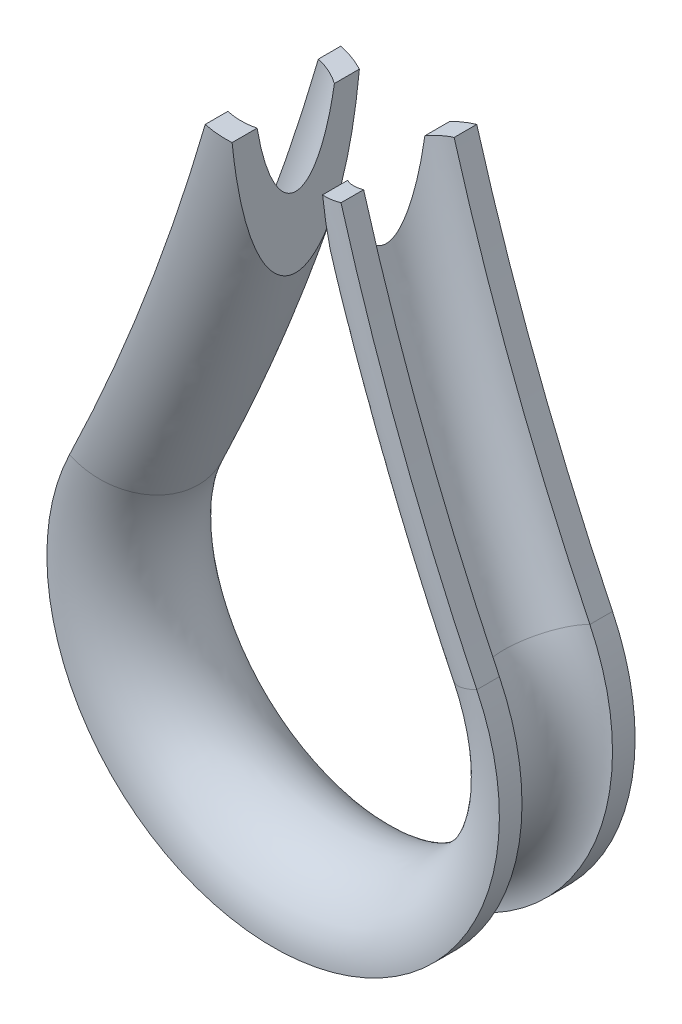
ISO-10303-21;
HEADER;
FILE_DESCRIPTION(('STEP AP214'),'2;1');
FILE_NAME('part.step','',(''),(''),'','','');
FILE_SCHEMA(('AUTOMOTIVE_DESIGN { 1 0 10303 214 1 1 1 1 }'));
ENDSEC;
DATA;
#1=APPLICATION_CONTEXT('core data for automotive mechanical design processes');
#2=APPLICATION_PROTOCOL_DEFINITION('international standard','automotive_design',2000,#1);
#3=PRODUCT_CONTEXT('',#1,'mechanical');
#4=PRODUCT('Part','Part','',(#3));
#5=PRODUCT_RELATED_PRODUCT_CATEGORY('part','',(#4));
#6=PRODUCT_DEFINITION_FORMATION('','',#4);
#7=PRODUCT_DEFINITION_CONTEXT('part definition',#1,'design');
#8=PRODUCT_DEFINITION('design','',#6,#7);
#9=PRODUCT_DEFINITION_SHAPE('','',#8);
#10=(LENGTH_UNIT() NAMED_UNIT(*) SI_UNIT(.MILLI.,.METRE.));
#11=(NAMED_UNIT(*) PLANE_ANGLE_UNIT() SI_UNIT($,.RADIAN.));
#12=(NAMED_UNIT(*) SI_UNIT($,.STERADIAN.) SOLID_ANGLE_UNIT());
#13=UNCERTAINTY_MEASURE_WITH_UNIT(LENGTH_MEASURE(1.E-05),#10,'distance_accuracy_value','');
#14=(GEOMETRIC_REPRESENTATION_CONTEXT(3) GLOBAL_UNCERTAINTY_ASSIGNED_CONTEXT((#13)) GLOBAL_UNIT_ASSIGNED_CONTEXT((#10,
#11,#12)) REPRESENTATION_CONTEXT('',''));
#15=CARTESIAN_POINT('',(0.,0.,0.));
#16=DIRECTION('',(0.,0.,1.));
#17=DIRECTION('',(1.,0.,0.));
#18=AXIS2_PLACEMENT_3D('',#15,#16,#17);
#19=CARTESIAN_POINT('',(9.07433486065,4.208600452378,1.999999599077));
#20=CARTESIAN_POINT('',(8.234728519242,5.934710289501,1.999999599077));
#21=CARTESIAN_POINT('',(6.67896024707,9.384823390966,1.999999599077));
#22=CARTESIAN_POINT('',(4.63573723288,14.71119966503,1.999999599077));
#23=CARTESIAN_POINT('',(3.484949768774,18.31667466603,1.999999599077));
#24=CARTESIAN_POINT('',(2.954737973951,20.16147900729,1.999999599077));
#25=CARTESIAN_POINT('',(8.697279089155,4.025194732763,2.000269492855));
#26=CARTESIAN_POINT('',(7.85411569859,5.758617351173,2.000269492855));
#27=CARTESIAN_POINT('',(6.291756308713,9.223347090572,2.000269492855));
#28=CARTESIAN_POINT('',(4.239877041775,14.57228891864,2.000269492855));
#29=CARTESIAN_POINT('',(3.084214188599,18.19303875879,2.000269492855));
#30=CARTESIAN_POINT('',(2.551756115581,20.04565873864,2.000269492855));
#31=CARTESIAN_POINT('',(7.944582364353,3.659071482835,1.728395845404));
#32=CARTESIAN_POINT('',(7.094318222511,5.407092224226,1.728395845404));
#33=CARTESIAN_POINT('',(5.518801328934,8.901000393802,1.728395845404));
#34=CARTESIAN_POINT('',(3.449642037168,14.29498865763,1.728395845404));
#35=CARTESIAN_POINT('',(2.28424669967,17.94623086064,1.728395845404));
#36=CARTESIAN_POINT('',(1.747304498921,19.81445279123,1.728395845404));
#37=CARTESIAN_POINT('',(7.246393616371,3.319461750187,0.6600536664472));
#38=CARTESIAN_POINT('',(6.389542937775,5.081023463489,0.6600536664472));
#39=CARTESIAN_POINT('',(4.801821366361,8.601997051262,0.6600536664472));
#40=CARTESIAN_POINT('',(2.716633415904,14.03776962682,0.6600536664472));
#41=CARTESIAN_POINT('',(1.542210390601,17.71729602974,0.6600536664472));
#42=CARTESIAN_POINT('',(1.00110878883,19.59999006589,0.6600536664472));
#43=CARTESIAN_POINT('',(7.246393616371,3.319461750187,-0.6600536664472));
#44=CARTESIAN_POINT('',(6.389542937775,5.081023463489,-0.6600536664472));
#45=CARTESIAN_POINT('',(4.801821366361,8.601997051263,-0.6600536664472));
#46=CARTESIAN_POINT('',(2.716633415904,14.03776962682,-0.6600536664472));
#47=CARTESIAN_POINT('',(1.5422103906,17.71729602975,-0.6600536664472));
#48=CARTESIAN_POINT('',(1.00110878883,19.59999006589,-0.6600536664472));
#49=CARTESIAN_POINT('',(7.944582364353,3.659071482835,-1.728395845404));
#50=CARTESIAN_POINT('',(7.094318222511,5.407092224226,-1.728395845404));
#51=CARTESIAN_POINT('',(5.518801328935,8.901000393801,-1.728395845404));
#52=CARTESIAN_POINT('',(3.449642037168,14.29498865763,-1.728395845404));
#53=CARTESIAN_POINT('',(2.284246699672,17.94623086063,-1.728395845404));
#54=CARTESIAN_POINT('',(1.747304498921,19.81445279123,-1.728395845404));
#55=CARTESIAN_POINT('',(8.697279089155,4.025194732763,-2.000269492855));
#56=CARTESIAN_POINT('',(7.85411569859,5.758617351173,-2.000269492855));
#57=CARTESIAN_POINT('',(6.291756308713,9.223347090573,-2.000269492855));
#58=CARTESIAN_POINT('',(4.239877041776,14.57228891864,-2.000269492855));
#59=CARTESIAN_POINT('',(3.084214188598,18.1930387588,-2.000269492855));
#60=CARTESIAN_POINT('',(2.551756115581,20.04565873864,-2.000269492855));
#61=CARTESIAN_POINT('',(9.07433486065,4.208600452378,-1.999999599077));
#62=CARTESIAN_POINT('',(8.234728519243,5.934710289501,-1.999999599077));
#63=CARTESIAN_POINT('',(6.67896024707,9.384823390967,-1.999999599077));
#64=CARTESIAN_POINT('',(4.635737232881,14.71119966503,-1.999999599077));
#65=CARTESIAN_POINT('',(3.484949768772,18.31667466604,-1.999999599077));
#66=CARTESIAN_POINT('',(2.954737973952,20.16147900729,-1.999999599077));
#67=B_SPLINE_SURFACE_WITH_KNOTS('',3,3,((#19,#20,#21,#22,#23,#24),(#25,#26,#27,#28,#29,#30),
(#31,#32,#33,#34,#35,#36),(#37,#38,#39,#40,#41,#42),(#43,#44,#45,#46,#47,#48),(#49,#50,#51,#52,
#53,#54),(#55,#56,#57,#58,#59,#60),(#61,#62,#63,#64,#65,#66)),.UNSPECIFIED.,.F.,.F.,.F.,(4,1,1,
1,1,4),(4,1,1,4),(-0.0001982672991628,0.2,0.4,0.6,0.8,1.000198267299),(-0.009996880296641,
0.3333333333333,0.6666666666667,1.00999844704),.UNSPECIFIED.);
#68=CARTESIAN_POINT('',(2.00000001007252,19.7107565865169,-1.70755012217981));
#69=CARTESIAN_POINT('',(2.09365838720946,19.7378466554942,-1.76676039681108));
#70=CARTESIAN_POINT('',(2.19225356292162,19.7663646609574,-1.81752587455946));
#71=CARTESIAN_POINT('',(2.39395211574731,19.8247046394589,-1.90022872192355));
#72=CARTESIAN_POINT('',(2.496906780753,19.8544835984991,-1.9325591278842));
#73=CARTESIAN_POINT('',(2.66662289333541,19.90357286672,-1.97031488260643));
#74=CARTESIAN_POINT('',(2.73228426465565,19.9225649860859,-1.98129490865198));
#75=CARTESIAN_POINT('',(2.86527415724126,19.9610314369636,-1.99618597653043));
#76=CARTESIAN_POINT('',(2.93261313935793,19.9805087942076,-1.99999549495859));
#77=CARTESIAN_POINT('',(3.00000000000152,20.0000000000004,-2.00000000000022));
#78=B_SPLINE_CURVE_WITH_KNOTS('',3,(#68,#69,#70,#71,#72,#73,#74,#75,#76,#77),.UNSPECIFIED.,.F.,
.F.,(4,2,2,2,4),(0.,0.341844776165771,0.676099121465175,0.883441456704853,1.09369798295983),.UNSPECIFIED.);
#79=CARTESIAN_POINT('',(2.00000000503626,19.7107565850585,-1.70755013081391));
#80=VERTEX_POINT('',#79);
#81=CARTESIAN_POINT('',(3.0000000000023,20.0000000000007,-2.00000000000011));
#82=VERTEX_POINT('',#81);
#83=EDGE_CURVE('E23',#80,#82,#78,.T.);
#84=CARTESIAN_POINT('',(2.,19.7107565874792,-1.70755011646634));
#85=CARTESIAN_POINT('',(2.,19.6251494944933,-1.69310005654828));
#86=CARTESIAN_POINT('',(2.,19.539660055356,-1.67793095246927));
#87=CARTESIAN_POINT('',(2.,19.3689096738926,-1.64597109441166));
#88=CARTESIAN_POINT('',(2.,19.2836489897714,-1.62917896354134));
#89=CARTESIAN_POINT('',(2.,19.1134689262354,-1.59380799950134));
#90=CARTESIAN_POINT('',(2.,19.0285496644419,-1.57522859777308));
#91=CARTESIAN_POINT('',(2.,18.8581672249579,-1.53588896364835));
#92=CARTESIAN_POINT('',(2.,18.772709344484,-1.51510571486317));
#93=CARTESIAN_POINT('',(2.,18.6023816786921,-1.471332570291));
#94=CARTESIAN_POINT('',(2.,18.5175117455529,-1.44834325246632));
#95=CARTESIAN_POINT('',(2.,18.3484999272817,-1.39989105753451));
#96=CARTESIAN_POINT('',(2.00000000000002,18.2643578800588,-1.37442874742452));
#97=CARTESIAN_POINT('',(2.00000000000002,18.0820499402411,-1.31589776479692));
#98=CARTESIAN_POINT('',(2.00000000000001,17.9840576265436,-1.28228226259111));
#99=CARTESIAN_POINT('',(1.99999999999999,17.7897340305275,-1.21038093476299));
#100=CARTESIAN_POINT('',(2.,17.693403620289,-1.17209273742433));
#101=CARTESIAN_POINT('',(2.,17.5030511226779,-1.08974516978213));
#102=CARTESIAN_POINT('',(2.,17.4090318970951,-1.04567903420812));
#103=CARTESIAN_POINT('',(2.,17.2708920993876,-0.974089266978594));
#104=CARTESIAN_POINT('',(2.,17.2253423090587,-0.949320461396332));
#105=CARTESIAN_POINT('',(2.,17.1354695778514,-0.897657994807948));
#106=CARTESIAN_POINT('',(2.,17.0911463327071,-0.870764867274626));
#107=CARTESIAN_POINT('',(2.,17.0034132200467,-0.814050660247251));
#108=CARTESIAN_POINT('',(2.,16.9600285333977,-0.784190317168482));
#109=CARTESIAN_POINT('',(2.,16.8755243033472,-0.721444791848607));
#110=CARTESIAN_POINT('',(2.,16.8344031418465,-0.688561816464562));
#111=CARTESIAN_POINT('',(2.,16.7557066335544,-0.619451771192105));
#112=CARTESIAN_POINT('',(2.,16.7181018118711,-0.583258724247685));
#113=CARTESIAN_POINT('',(2.,16.6473621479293,-0.506665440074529));
#114=CARTESIAN_POINT('',(2.,16.614225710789,-0.466266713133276));
#115=CARTESIAN_POINT('',(2.,16.561097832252,-0.390432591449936));
#116=CARTESIAN_POINT('',(2.,16.5398237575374,-0.355906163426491));
#117=CARTESIAN_POINT('',(2.,16.5024523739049,-0.284203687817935));
#118=CARTESIAN_POINT('',(2.,16.4863426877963,-0.247034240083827));
#119=CARTESIAN_POINT('',(2.,16.4604599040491,-0.170005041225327));
#120=CARTESIAN_POINT('',(2.,16.4507633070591,-0.130118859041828));
#121=CARTESIAN_POINT('',(2.,16.4391761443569,-0.0492405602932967));
#122=CARTESIAN_POINT('',(2.,16.4372755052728,-0.00824993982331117));
#123=CARTESIAN_POINT('',(2.,16.4412856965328,0.069116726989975));
#124=CARTESIAN_POINT('',(2.,16.4464180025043,0.105536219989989));
#125=CARTESIAN_POINT('',(2.,16.4626032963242,0.177035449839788));
#126=CARTESIAN_POINT('',(2.,16.4736619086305,0.21211387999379));
#127=CARTESIAN_POINT('',(2.,16.5055733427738,0.292352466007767));
#128=CARTESIAN_POINT('',(2.,16.5285086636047,0.336676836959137));
#129=CARTESIAN_POINT('',(2.,16.5810997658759,0.421224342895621));
#130=CARTESIAN_POINT('',(2.,16.6107825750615,0.46143001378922));
#131=CARTESIAN_POINT('',(2.,16.6977487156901,0.565170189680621));
#132=CARTESIAN_POINT('',(2.,16.759598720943,0.624846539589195));
#133=CARTESIAN_POINT('',(2.,16.8579777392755,0.707355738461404));
#134=CARTESIAN_POINT('',(2.,16.8917632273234,0.73372774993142));
#135=CARTESIAN_POINT('',(2.,16.960804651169,0.784478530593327));
#136=CARTESIAN_POINT('',(2.,16.9960601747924,0.808857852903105));
#137=CARTESIAN_POINT('',(2.,17.1027942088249,0.878932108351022));
#138=CARTESIAN_POINT('',(1.99999999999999,17.1759184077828,0.922107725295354));
#139=CARTESIAN_POINT('',(2.00000000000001,17.3248880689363,1.00315040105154));
#140=CARTESIAN_POINT('',(2.00000000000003,17.4007305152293,1.04102312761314));
#141=CARTESIAN_POINT('',(1.99999999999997,17.5543776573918,1.11253506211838));
#142=CARTESIAN_POINT('',(1.9999999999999,17.6321825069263,1.1461739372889));
#143=CARTESIAN_POINT('',(2.0000000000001,17.7897347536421,1.21014338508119));
#144=CARTESIAN_POINT('',(2.00000000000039,17.8694916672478,1.24045030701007));
#145=CARTESIAN_POINT('',(1.99999999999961,18.0300644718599,1.2980185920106));
#146=CARTESIAN_POINT('',(1.99999999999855,18.1108800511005,1.32528083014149));
#147=CARTESIAN_POINT('',(2.00000000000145,18.273344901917,1.3771679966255));
#148=CARTESIAN_POINT('',(2.0000000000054,18.3549941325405,1.40179305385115));
#149=CARTESIAN_POINT('',(2.00000000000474,18.5072980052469,1.44537881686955));
#150=CARTESIAN_POINT('',(2.00000000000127,18.5778651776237,1.46464706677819));
#151=CARTESIAN_POINT('',(1.99999999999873,18.719403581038,1.50162579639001));
#152=CARTESIAN_POINT('',(1.99999999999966,18.7903748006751,1.51933631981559));
#153=CARTESIAN_POINT('',(2.00000000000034,18.9326610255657,1.55333180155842));
#154=CARTESIAN_POINT('',(2.00000000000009,19.0039760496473,1.56961668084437));
#155=CARTESIAN_POINT('',(1.99999999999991,19.1456800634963,1.60060203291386));
#156=CARTESIAN_POINT('',(1.99999999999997,19.216064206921,1.6153247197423));
#157=CARTESIAN_POINT('',(2.00000000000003,19.3570625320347,1.64359001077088));
#158=CARTESIAN_POINT('',(2.00000000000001,19.4276766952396,1.65713270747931));
#159=CARTESIAN_POINT('',(1.99999999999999,19.5690855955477,1.68313133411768));
#160=CARTESIAN_POINT('',(1.99999999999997,19.6398802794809,1.69558755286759));
#161=CARTESIAN_POINT('',(2.,19.7107565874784,1.70755011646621));
#162=B_SPLINE_CURVE_WITH_KNOTS('',3,(#84,#85,#86,#87,#88,#89,#90,#91,#92,#93,#94,#95,#96,#97,
#98,#99,#100,#101,#102,#103,#104,#105,#106,#107,#108,#109,#110,#111,#112,#113,#114,#115,#116,
#117,#118,#119,#120,#121,#122,#123,#124,#125,#126,#127,#128,#129,#130,#131,#132,#133,#134,#135,
#136,#137,#138,#139,#140,#141,#142,#143,#144,#145,#146,#147,#148,#149,#150,#151,#152,#153,#154,
#155,#156,#157,#158,#159,#160,#161),.UNSPECIFIED.,.F.,.F.,(4,2,2,2,2,2,2,2,2,2,2,2,2,2,2,2,2,2,
2,2,2,2,2,2,2,2,2,2,2,2,2,2,2,2,2,2,2,2,4),(0.,0.260456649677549,0.521136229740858,
0.781899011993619,1.04571929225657,1.30947064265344,1.57316166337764,1.88385360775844,
2.1947039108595,2.50592148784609,2.6614224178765,2.81688442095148,2.97478148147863,
3.13256416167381,3.28887631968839,3.44513253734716,3.5664623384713,3.68749914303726,
3.80995491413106,3.93225240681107,4.04205036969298,4.15195272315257,4.30082617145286,
4.45030679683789,4.70659658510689,4.83515289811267,4.96367340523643,5.21811833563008,
5.4722892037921,5.72648003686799,5.98237225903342,6.23819074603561,6.49399672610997,
6.71342951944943,6.93285615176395,7.1522949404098,7.3680063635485,7.5837008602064,
7.79933784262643),.UNSPECIFIED.);
#163=CARTESIAN_POINT('',(2.00000000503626,19.7107565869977,1.70755011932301));
#164=VERTEX_POINT('',#163);
#165=EDGE_CURVE('E113',#80,#164,#162,.T.);
#166=CARTESIAN_POINT('',(3.00000000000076,20.0000000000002,2.00000000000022));
#167=CARTESIAN_POINT('',(2.8904107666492,19.9683020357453,2.00000910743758));
#168=CARTESIAN_POINT('',(2.78086379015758,19.936616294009,1.98991551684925));
#169=CARTESIAN_POINT('',(2.56735910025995,19.8748614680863,1.95105542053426));
#170=CARTESIAN_POINT('',(2.46333135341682,19.8447721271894,1.92270688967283));
#171=CARTESIAN_POINT('',(2.2995966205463,19.7974129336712,1.86279540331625));
#172=CARTESIAN_POINT('',(2.23805201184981,19.779611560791,1.83653508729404));
#173=CARTESIAN_POINT('',(2.11703744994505,19.744608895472,1.77716238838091));
#174=CARTESIAN_POINT('',(2.05760863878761,19.7274195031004,1.74395916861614));
#175=CARTESIAN_POINT('',(2.00000001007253,19.7107565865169,1.70755012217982));
#176=B_SPLINE_CURVE_WITH_KNOTS('',3,(#166,#167,#168,#169,#170,#171,#172,#173,#174,#175),
.UNSPECIFIED.,.F.,.F.,(4,2,2,2,4),(0.,0.34178540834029,0.676010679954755,0.883397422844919,
1.09368944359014),.UNSPECIFIED.);
#177=CARTESIAN_POINT('',(3.00000000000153,20.0000000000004,2.));
#178=VERTEX_POINT('',#177);
#179=EDGE_CURVE('E129',#178,#164,#176,.T.);
#180=CARTESIAN_POINT('',(98.07462774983,47.49971014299,2.));
#181=DIRECTION('',(0.,0.,-1.));
#182=DIRECTION('',(-1.,0.,0.));
#183=AXIS2_PLACEMENT_3D('',#180,#181,#182);
#184=CIRCLE('',#183,98.97180861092);
#185=CARTESIAN_POINT('',(9.00000000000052,4.35889894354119,1.99999999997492));
#186=VERTEX_POINT('',#185);
#187=EDGE_CURVE('E307',#178,#186,#184,.F.);
#188=CARTESIAN_POINT('',(9.01129448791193,4.36436911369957,-1.99995918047));
#189=CARTESIAN_POINT('',(8.6305293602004,4.17995614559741,-2.002708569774));
#190=CARTESIAN_POINT('',(7.87252352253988,3.8128371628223,-1.73160289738));
#191=CARTESIAN_POINT('',(7.17166400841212,3.47339540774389,-0.6600536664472));
#192=CARTESIAN_POINT('',(7.17166400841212,3.47339540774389,0.6600536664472));
#193=CARTESIAN_POINT('',(7.87252352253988,3.8128371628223,1.73160289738));
#194=CARTESIAN_POINT('',(8.6305293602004,4.17995614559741,2.002708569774));
#195=CARTESIAN_POINT('',(9.01129448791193,4.36436911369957,1.99995918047));
#196=B_SPLINE_CURVE_WITH_KNOTS('',3,(#188,#189,#190,#191,#192,#193,#194,#195),.UNSPECIFIED.,.F.,
.F.,(4,1,1,1,1,4),(-0.002,0.2,0.4,0.6,0.8,1.002),.UNSPECIFIED.);
#197=CARTESIAN_POINT('',(8.99999999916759,4.35889894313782,-1.99999999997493));
#198=VERTEX_POINT('',#197);
#199=EDGE_CURVE('E135',#198,#186,#196,.T.);
#200=CARTESIAN_POINT('',(98.07462774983,47.49971014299,-2.));
#201=DIRECTION('',(0.,0.,-1.));
#202=DIRECTION('',(-1.,0.,0.));
#203=AXIS2_PLACEMENT_3D('',#200,#201,#202);
#204=CIRCLE('',#203,98.97180861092);
#205=EDGE_CURVE('E117',#198,#82,#204,.T.);
#206=ORIENTED_EDGE('',*,*,#83,.F.);
#207=ORIENTED_EDGE('',*,*,#165,.T.);
#208=ORIENTED_EDGE('',*,*,#179,.F.);
#209=ORIENTED_EDGE('',*,*,#187,.T.);
#210=ORIENTED_EDGE('',*,*,#199,.F.);
#211=ORIENTED_EDGE('',*,*,#205,.T.);
#212=EDGE_LOOP('',(#206,#207,#208,#209,#210,#211));
#213=FACE_BOUND('',#212,.T.);
#214=ADVANCED_FACE('F16',(#213),#67,.T.);
#215=CARTESIAN_POINT('',(-2.954745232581,20.16145375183,1.999999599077));
#216=CARTESIAN_POINT('',(-3.484955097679,18.31665796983,1.999999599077));
#217=CARTESIAN_POINT('',(-4.635740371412,14.71119148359,1.999999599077));
#218=CARTESIAN_POINT('',(-6.678963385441,9.384815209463,1.999999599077));
#219=CARTESIAN_POINT('',(-8.234735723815,5.934694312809,1.999999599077));
#220=CARTESIAN_POINT('',(-9.074346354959,4.208576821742,1.999999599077));
#221=CARTESIAN_POINT('',(-2.551763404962,20.04563337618,2.000269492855));
#222=CARTESIAN_POINT('',(-3.08421954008,18.19302199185,2.000269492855));
#223=CARTESIAN_POINT('',(-4.239880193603,14.57228070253,2.000269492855));
#224=CARTESIAN_POINT('',(-6.29175946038,9.223338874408,2.000269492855));
#225=CARTESIAN_POINT('',(-7.854122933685,5.758601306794,2.000269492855));
#226=CARTESIAN_POINT('',(-8.69729063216,4.025171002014,2.000269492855));
#227=CARTESIAN_POINT('',(-1.74731184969,19.81442721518,1.728395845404));
#228=CARTESIAN_POINT('',(-2.28425209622,17.94621395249,1.728395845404));
#229=CARTESIAN_POINT('',(-3.44964521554,14.29498037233,1.728395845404));
#230=CARTESIAN_POINT('',(-5.518804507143,8.900992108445,1.728395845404));
#231=CARTESIAN_POINT('',(-7.094325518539,5.407076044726,1.728395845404));
#232=CARTESIAN_POINT('',(-7.944594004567,3.659047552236,1.728395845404));
#233=CARTESIAN_POINT('',(-1.001116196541,19.59996429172,0.6600536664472));
#234=CARTESIAN_POINT('',(-1.542215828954,17.71727899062,0.6600536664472));
#235=CARTESIAN_POINT('',(-2.716636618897,14.03776127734,0.6600536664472));
#236=CARTESIAN_POINT('',(-4.801824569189,8.601988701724,0.6600536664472));
#237=CARTESIAN_POINT('',(-6.389550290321,5.081007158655,0.6600536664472));
#238=CARTESIAN_POINT('',(-7.246405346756,3.319437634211,0.6600536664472));
#239=CARTESIAN_POINT('',(-1.001116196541,19.59996429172,-0.6600536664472));
#240=CARTESIAN_POINT('',(-1.542215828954,17.71727899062,-0.6600536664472));
#241=CARTESIAN_POINT('',(-2.716636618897,14.03776127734,-0.6600536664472));
#242=CARTESIAN_POINT('',(-4.801824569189,8.601988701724,-0.6600536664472));
#243=CARTESIAN_POINT('',(-6.389550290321,5.081007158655,-0.6600536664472));
#244=CARTESIAN_POINT('',(-7.246405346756,3.319437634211,-0.6600536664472));
#245=CARTESIAN_POINT('',(-1.74731184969,19.81442721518,-1.728395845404));
#246=CARTESIAN_POINT('',(-2.28425209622,17.94621395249,-1.728395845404));
#247=CARTESIAN_POINT('',(-3.44964521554,14.29498037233,-1.728395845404));
#248=CARTESIAN_POINT('',(-5.518804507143,8.900992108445,-1.728395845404));
#249=CARTESIAN_POINT('',(-7.094325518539,5.407076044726,-1.728395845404));
#250=CARTESIAN_POINT('',(-7.944594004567,3.659047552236,-1.728395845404));
#251=CARTESIAN_POINT('',(-2.551763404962,20.04563337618,-2.000269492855));
#252=CARTESIAN_POINT('',(-3.084219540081,18.19302199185,-2.000269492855));
#253=CARTESIAN_POINT('',(-4.239880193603,14.57228070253,-2.000269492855));
#254=CARTESIAN_POINT('',(-6.29175946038,9.223338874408,-2.000269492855));
#255=CARTESIAN_POINT('',(-7.854122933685,5.758601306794,-2.000269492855));
#256=CARTESIAN_POINT('',(-8.69729063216,4.025171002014,-2.000269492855));
#257=CARTESIAN_POINT('',(-2.954745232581,20.16145375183,-1.999999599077));
#258=CARTESIAN_POINT('',(-3.484955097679,18.31665796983,-1.999999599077));
#259=CARTESIAN_POINT('',(-4.635740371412,14.71119148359,-1.999999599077));
#260=CARTESIAN_POINT('',(-6.678963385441,9.384815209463,-1.999999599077));
#261=CARTESIAN_POINT('',(-8.234735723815,5.934694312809,-1.999999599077));
#262=CARTESIAN_POINT('',(-9.074346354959,4.208576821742,-1.999999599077));
#263=B_SPLINE_SURFACE_WITH_KNOTS('',3,3,((#215,#216,#217,#218,#219,#220),(#221,#222,#223,#224,
#225,#226),(#227,#228,#229,#230,#231,#232),(#233,#234,#235,#236,#237,#238),(#239,#240,#241,#242,
#243,#244),(#245,#246,#247,#248,#249,#250),(#251,#252,#253,#254,#255,#256),(#257,#258,#259,#260,
#261,#262)),.UNSPECIFIED.,.F.,.F.,.F.,(4,1,1,1,1,4),(4,1,1,4),(-0.0001982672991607,0.2,0.4,0.6,
0.8,1.000198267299),(-0.00999688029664,0.3333333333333,0.6666666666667,1.00999844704),.UNSPECIFIED.);
#264=CARTESIAN_POINT('',(-3.00000000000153,20.0000000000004,2.00000000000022));
#265=CARTESIAN_POINT('',(-2.89041076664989,19.9683020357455,2.00000910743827));
#266=CARTESIAN_POINT('',(-2.78086379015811,19.9366162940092,1.98991551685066));
#267=CARTESIAN_POINT('',(-2.56735910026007,19.8748614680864,1.95105542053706));
#268=CARTESIAN_POINT('',(-2.46333135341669,19.8447721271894,1.9227068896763));
#269=CARTESIAN_POINT('',(-2.29959662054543,19.7974129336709,1.86279540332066));
#270=CARTESIAN_POINT('',(-2.23805201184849,19.7796115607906,1.83653508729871));
#271=CARTESIAN_POINT('',(-2.11703744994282,19.7446088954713,1.77716238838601));
#272=CARTESIAN_POINT('',(-2.05760863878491,19.7274195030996,1.74395916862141));
#273=CARTESIAN_POINT('',(-2.00000001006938,19.710756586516,1.70755012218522));
#274=B_SPLINE_CURVE_WITH_KNOTS('',3,(#264,#265,#266,#267,#268,#269,#270,#271,#272,#273),
.UNSPECIFIED.,.F.,.F.,(4,2,2,2,4),(0.,0.341785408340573,0.676010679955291,0.883397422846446,
1.0936894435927),.UNSPECIFIED.);
#275=CARTESIAN_POINT('',(-3.0000000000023,20.0000000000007,2.00000000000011));
#276=VERTEX_POINT('',#275);
#277=CARTESIAN_POINT('',(-2.00000000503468,19.710756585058,1.70755013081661));
#278=VERTEX_POINT('',#277);
#279=EDGE_CURVE('E142',#276,#278,#274,.T.);
#280=CARTESIAN_POINT('',(-2.,19.7107565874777,1.70755011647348));
#281=CARTESIAN_POINT('',(-2.,19.6251494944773,1.69310005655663));
#282=CARTESIAN_POINT('',(-2.,19.5396600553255,1.67793095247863));
#283=CARTESIAN_POINT('',(-2.,19.3689096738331,1.64597109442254));
#284=CARTESIAN_POINT('',(-2.,19.2836489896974,1.62917896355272));
#285=CARTESIAN_POINT('',(-2.,19.1134689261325,1.59380799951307));
#286=CARTESIAN_POINT('',(-2.,19.0285496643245,1.57522859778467));
#287=CARTESIAN_POINT('',(-2.,18.8581672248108,1.53588896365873));
#288=CARTESIAN_POINT('',(-2.,18.7727093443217,1.51510571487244));
#289=CARTESIAN_POINT('',(-2.,18.6023816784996,1.47133257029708));
#290=CARTESIAN_POINT('',(-2.,18.5175117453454,1.44834325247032));
#291=CARTESIAN_POINT('',(-2.,18.3484999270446,1.39989105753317));
#292=CARTESIAN_POINT('',(-2.00000000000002,18.2643578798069,1.37442874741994));
#293=CARTESIAN_POINT('',(-2.00000000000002,18.0820499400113,1.31589776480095));
#294=CARTESIAN_POINT('',(-2.00000000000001,17.9840576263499,1.28228226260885));
#295=CARTESIAN_POINT('',(-1.99999999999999,17.7897340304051,1.21038093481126));
#296=CARTESIAN_POINT('',(-2.,17.6934036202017,1.17209273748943));
#297=CARTESIAN_POINT('',(-2.,17.5030511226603,1.08974516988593));
#298=CARTESIAN_POINT('',(-2.,17.4090318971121,1.0456790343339));
#299=CARTESIAN_POINT('',(-2.,17.2708920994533,0.974089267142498));
#300=CARTESIAN_POINT('',(-2.,17.22534230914,0.949320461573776));
#301=CARTESIAN_POINT('',(-2.,17.1354695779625,0.897657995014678));
#302=CARTESIAN_POINT('',(-2.,17.0911463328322,0.870764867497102));
#303=CARTESIAN_POINT('',(-2.,17.0034132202,0.814050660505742));
#304=CARTESIAN_POINT('',(-2.,16.960028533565,0.784190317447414));
#305=CARTESIAN_POINT('',(-2.,16.8755243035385,0.721444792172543));
#306=CARTESIAN_POINT('',(-2.,16.8344031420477,0.688561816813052));
#307=CARTESIAN_POINT('',(-2.,16.7557066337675,0.619451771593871));
#308=CARTESIAN_POINT('',(-2.,16.7181018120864,0.583258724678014));
#309=CARTESIAN_POINT('',(-2.,16.6473621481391,0.506665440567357));
#310=CARTESIAN_POINT('',(-2.,16.6142257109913,0.466266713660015));
#311=CARTESIAN_POINT('',(-2.,16.5610978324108,0.390432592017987));
#312=CARTESIAN_POINT('',(-2.,16.5398237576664,0.355906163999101));
#313=CARTESIAN_POINT('',(-2.,16.5024523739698,0.284203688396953));
#314=CARTESIAN_POINT('',(-2.,16.486342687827,0.247034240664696));
#315=CARTESIAN_POINT('',(-2.,16.4604599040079,0.170005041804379));
#316=CARTESIAN_POINT('',(-2.,16.4507633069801,0.130118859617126));
#317=CARTESIAN_POINT('',(-2.,16.4391761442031,0.0492405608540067));
#318=CARTESIAN_POINT('',(-2.,16.437275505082,0.00824994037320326));
#319=CARTESIAN_POINT('',(-2.,16.4412856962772,-0.0691167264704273));
#320=CARTESIAN_POINT('',(-2.,16.4464180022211,-0.105536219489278));
#321=CARTESIAN_POINT('',(-2.,16.4626032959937,-0.177035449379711));
#322=CARTESIAN_POINT('',(-2.,16.4736619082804,-0.212113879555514));
#323=CARTESIAN_POINT('',(-2.,16.5055733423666,-0.292352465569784));
#324=CARTESIAN_POINT('',(-2.,16.5285086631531,-0.336676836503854));
#325=CARTESIAN_POINT('',(-2.,16.5810997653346,-0.421224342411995));
#326=CARTESIAN_POINT('',(-2.,16.6107825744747,-0.461430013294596));
#327=CARTESIAN_POINT('',(-2.,16.6977487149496,-0.565170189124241));
#328=CARTESIAN_POINT('',(-2.,16.7595987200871,-0.624846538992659));
#329=CARTESIAN_POINT('',(-2.,16.8579777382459,-0.707355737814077));
#330=CARTESIAN_POINT('',(-2.,16.8917632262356,-0.733727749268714));
#331=CARTESIAN_POINT('',(-2.,16.9608046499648,-0.784478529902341));
#332=CARTESIAN_POINT('',(-2.,16.9960601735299,-0.808857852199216));
#333=CARTESIAN_POINT('',(-2.,17.1027942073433,-0.878932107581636));
#334=CARTESIAN_POINT('',(-1.99999999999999,17.1759184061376,-0.922107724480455));
#335=CARTESIAN_POINT('',(-2.00000000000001,17.3248880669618,-1.00315040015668));
#336=CARTESIAN_POINT('',(-2.00000000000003,17.4007305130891,-1.04102312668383));
#337=CARTESIAN_POINT('',(-1.99999999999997,17.5543776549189,-1.11253506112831));
#338=CARTESIAN_POINT('',(-1.9999999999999,17.6321825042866,-1.14617393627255));
#339=CARTESIAN_POINT('',(-2.0000000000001,17.7897347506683,-1.21014338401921));
#340=CARTESIAN_POINT('',(-2.00000000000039,17.8694916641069,-1.24045030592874));
#341=CARTESIAN_POINT('',(-1.99999999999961,18.0300644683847,-1.29801859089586));
#342=CARTESIAN_POINT('',(-1.99999999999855,18.1108800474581,-1.3252808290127));
#343=CARTESIAN_POINT('',(-2.00000000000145,18.2733448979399,-1.3771679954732));
#344=CARTESIAN_POINT('',(-2.0000000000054,18.3549941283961,-1.40179305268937));
#345=CARTESIAN_POINT('',(-2.00000000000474,18.5072980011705,-1.44537881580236));
#346=CARTESIAN_POINT('',(-2.00000000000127,18.5778651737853,-1.4646470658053));
#347=CARTESIAN_POINT('',(-1.99999999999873,18.7194035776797,-1.50162579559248));
#348=CARTESIAN_POINT('',(-1.99999999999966,18.7903747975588,-1.51933631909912));
#349=CARTESIAN_POINT('',(-2.00000000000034,18.9326610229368,-1.55333180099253));
#350=CARTESIAN_POINT('',(-2.00000000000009,19.0039760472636,-1.56961668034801));
#351=CARTESIAN_POINT('',(-1.99999999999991,19.1456800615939,-1.60060203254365));
#352=CARTESIAN_POINT('',(-1.99999999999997,19.2160642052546,-1.61532471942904));
#353=CARTESIAN_POINT('',(-2.00000000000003,19.3570625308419,-1.64359001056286));
#354=CARTESIAN_POINT('',(-2.00000000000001,19.4276766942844,-1.65713270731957));
#355=CARTESIAN_POINT('',(-1.99999999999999,19.5690855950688,-1.68313133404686));
#356=CARTESIAN_POINT('',(-1.99999999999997,19.6398802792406,-1.6955875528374));
#357=CARTESIAN_POINT('',(-2.,19.7107565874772,-1.70755011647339));
#358=B_SPLINE_CURVE_WITH_KNOTS('',3,(#280,#281,#282,#283,#284,#285,#286,#287,#288,#289,#290,
#291,#292,#293,#294,#295,#296,#297,#298,#299,#300,#301,#302,#303,#304,#305,#306,#307,#308,#309,
#310,#311,#312,#313,#314,#315,#316,#317,#318,#319,#320,#321,#322,#323,#324,#325,#326,#327,#328,
#329,#330,#331,#332,#333,#334,#335,#336,#337,#338,#339,#340,#341,#342,#343,#344,#345,#346,#347,
#348,#349,#350,#351,#352,#353,#354,#355,#356,#357),.UNSPECIFIED.,.F.,.F.,(4,2,2,2,2,2,2,2,2,2,2,
2,2,2,2,2,2,2,2,2,2,2,2,2,2,2,2,2,2,2,2,2,2,2,2,2,2,2,4),(0.,0.260456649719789,
0.521136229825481,0.78189901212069,1.04571929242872,1.30947064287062,1.57316166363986,
1.88385360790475,2.19470391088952,2.50592148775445,2.66142241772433,2.81688442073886,
2.97478148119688,3.13256416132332,3.28887631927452,3.44513253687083,3.56646233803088,
3.68749914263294,3.80995491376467,3.93225240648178,4.04205036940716,4.15195272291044,
4.30082617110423,4.45030679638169,4.70659658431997,4.83515289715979,4.96367340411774,
5.21811833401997,5.47228920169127,5.72648003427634,5.98237225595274,6.23819074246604,
6.49399672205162,6.71342951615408,6.93285614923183,7.15229493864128,7.36800636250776,
7.58370085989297,7.79933784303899),.UNSPECIFIED.);
#359=CARTESIAN_POINT('',(-2.00000000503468,19.7107565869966,-1.70755011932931));
#360=VERTEX_POINT('',#359);
#361=EDGE_CURVE('E291',#278,#360,#358,.T.);
#362=CARTESIAN_POINT('',(-2.00000001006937,19.710756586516,-1.70755012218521));
#363=CARTESIAN_POINT('',(-2.09365838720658,19.7378466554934,-1.76676039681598));
#364=CARTESIAN_POINT('',(-2.19225356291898,19.7663646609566,-1.81752587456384));
#365=CARTESIAN_POINT('',(-2.39395211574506,19.8247046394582,-1.90022872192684));
#366=CARTESIAN_POINT('',(-2.4969067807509,19.8544835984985,-1.93255912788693));
#367=CARTESIAN_POINT('',(-2.66662289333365,19.9035728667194,-1.97031488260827));
#368=CARTESIAN_POINT('',(-2.73228426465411,19.9225649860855,-1.98129490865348));
#369=CARTESIAN_POINT('',(-2.86527415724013,19.9610314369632,-1.99618597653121));
#370=CARTESIAN_POINT('',(-2.93261313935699,19.9805087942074,-1.99999549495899));
#371=CARTESIAN_POINT('',(-3.00000000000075,20.0000000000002,-2.00000000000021));
#372=B_SPLINE_CURVE_WITH_KNOTS('',3,(#362,#363,#364,#365,#366,#367,#368,#369,#370,#371),
.UNSPECIFIED.,.F.,.F.,(4,2,2,2,4),(0.,0.341844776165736,0.676099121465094,0.883441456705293,
1.09369798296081),.UNSPECIFIED.);
#373=CARTESIAN_POINT('',(-3.00000000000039,20.0000000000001,-2.00000000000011));
#374=VERTEX_POINT('',#373);
#375=EDGE_CURVE('E296',#360,#374,#372,.T.);
#376=CARTESIAN_POINT('',(-98.07462774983,47.49971014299,-2.));
#377=DIRECTION('',(0.,0.,-1.));
#378=DIRECTION('',(-1.,0.,0.));
#379=AXIS2_PLACEMENT_3D('',#376,#377,#378);
#380=CIRCLE('',#379,98.97180861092);
#381=CARTESIAN_POINT('',(-9.00000000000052,4.35889894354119,-1.99999999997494));
#382=VERTEX_POINT('',#381);
#383=EDGE_CURVE('E300',#374,#382,#380,.T.);
#384=CARTESIAN_POINT('',(-9.01129449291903,4.36436911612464,1.99995918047));
#385=CARTESIAN_POINT('',(-8.63052936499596,4.17995614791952,2.002708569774));
#386=CARTESIAN_POINT('',(-7.87252352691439,3.81283716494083,1.73160289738));
#387=CARTESIAN_POINT('',(-7.17166401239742,3.47339540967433,0.6600536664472));
#388=CARTESIAN_POINT('',(-7.17166401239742,3.47339540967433,-0.6600536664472));
#389=CARTESIAN_POINT('',(-7.87252352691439,3.81283716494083,-1.73160289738));
#390=CARTESIAN_POINT('',(-8.63052936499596,4.17995614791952,-2.002708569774));
#391=CARTESIAN_POINT('',(-9.01129449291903,4.36436911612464,-1.99995918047));
#392=B_SPLINE_CURVE_WITH_KNOTS('',3,(#384,#385,#386,#387,#388,#389,#390,#391),.UNSPECIFIED.,.F.,
.F.,(4,1,1,1,1,4),(-0.002,0.2,0.4,0.6,0.8,1.002),.UNSPECIFIED.);
#393=CARTESIAN_POINT('',(-9.00000000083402,4.35889894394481,1.99999999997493));
#394=VERTEX_POINT('',#393);
#395=EDGE_CURVE('E324',#394,#382,#392,.T.);
#396=CARTESIAN_POINT('',(-98.07462774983,47.49971014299,2.));
#397=DIRECTION('',(0.,0.,-1.));
#398=DIRECTION('',(-1.,0.,0.));
#399=AXIS2_PLACEMENT_3D('',#396,#397,#398);
#400=CIRCLE('',#399,98.97180861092);
#401=EDGE_CURVE('E299',#394,#276,#400,.F.);
#402=ORIENTED_EDGE('',*,*,#279,.T.);
#403=ORIENTED_EDGE('',*,*,#361,.T.);
#404=ORIENTED_EDGE('',*,*,#375,.T.);
#405=ORIENTED_EDGE('',*,*,#383,.T.);
#406=ORIENTED_EDGE('',*,*,#395,.F.);
#407=ORIENTED_EDGE('',*,*,#401,.T.);
#408=EDGE_LOOP('',(#402,#403,#404,#405,#406,#407));
#409=FACE_BOUND('',#408,.T.);
#410=ADVANCED_FACE('F158',(#409),#263,.T.);
#411=CARTESIAN_POINT('',(3.,20.,0.));
#412=DIRECTION('',(-0.277853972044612,0.960623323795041,0.));
#413=DIRECTION('',(-0.960623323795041,-0.277853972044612,0.));
#414=AXIS2_PLACEMENT_3D('',#411,#412,#413);
#415=PLANE('',#414);
#416=CARTESIAN_POINT('',(2.00000000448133,19.7107565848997,-2.81311489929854));
#417=CARTESIAN_POINT('',(2.04019208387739,19.7223818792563,-2.82855141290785));
#418=CARTESIAN_POINT('',(2.08071219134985,19.7341020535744,-2.84306158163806));
#419=CARTESIAN_POINT('',(2.16209271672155,19.7576408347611,-2.87012898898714));
#420=CARTESIAN_POINT('',(2.20294982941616,19.7694584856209,-2.8826969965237));
#421=CARTESIAN_POINT('',(2.28499522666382,19.7931895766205,-2.90591333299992));
#422=CARTESIAN_POINT('',(2.32618162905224,19.8051024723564,-2.91656887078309));
#423=CARTESIAN_POINT('',(2.4088808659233,19.8290226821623,-2.93597855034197));
#424=CARTESIAN_POINT('',(2.45039290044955,19.8410297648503,-2.94473638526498));
#425=CARTESIAN_POINT('',(2.53374750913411,19.8651395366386,-2.96035537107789));
#426=CARTESIAN_POINT('',(2.57559010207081,19.8772422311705,-2.96721641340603));
#427=CARTESIAN_POINT('',(2.65960522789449,19.9015430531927,-2.97902986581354));
#428=CARTESIAN_POINT('',(2.70177824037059,19.913741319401,-2.98397858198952));
#429=CARTESIAN_POINT('',(2.78645694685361,19.9382340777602,-2.99194094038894));
#430=CARTESIAN_POINT('',(2.82896329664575,19.9505287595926,-2.9949470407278));
#431=CARTESIAN_POINT('',(2.91431243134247,19.9752154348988,-2.99898247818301));
#432=CARTESIAN_POINT('',(2.95715572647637,19.987607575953,-3.00000010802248));
#433=CARTESIAN_POINT('',(3.00000000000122,20.0000000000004,-3.00000000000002));
#434=B_SPLINE_CURVE_WITH_KNOTS('',3,(#416,#417,#418,#419,#420,#421,#422,#423,#424,#425,#426,
#427,#428,#429,#430,#431,#432,#433),.UNSPECIFIED.,.F.,.F.,(4,2,2,2,2,2,2,2,4),(0.,
0.133777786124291,0.266784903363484,0.399279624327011,0.531514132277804,0.663756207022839,
0.796252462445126,0.9292600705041,1.06304843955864),.UNSPECIFIED.);
#435=CARTESIAN_POINT('',(2.00000000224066,19.7107565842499,-2.81311490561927));
#436=VERTEX_POINT('',#435);
#437=CARTESIAN_POINT('',(3.00000000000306,20.0000000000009,-3.));
#438=VERTEX_POINT('',#437);
#439=EDGE_CURVE('E125',#436,#438,#434,.T.);
#440=ORIENTED_EDGE('',*,*,#439,.F.);
#441=DIRECTION('',(0.,0.,-1.));
#442=VECTOR('',#441,1.);
#443=CARTESIAN_POINT('',(2.,19.7107565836,3.));
#444=LINE('',#443,#442);
#445=EDGE_CURVE('E122',#436,#80,#444,.F.);
#446=ORIENTED_EDGE('',*,*,#445,.T.);
#447=ORIENTED_EDGE('',*,*,#83,.T.);
#448=DIRECTION('',(0.,0.,-1.));
#449=VECTOR('',#448,1.);
#450=CARTESIAN_POINT('',(3.00000000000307,20.0000000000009,0.));
#451=LINE('',#450,#449);
#452=EDGE_CURVE('E185',#82,#438,#451,.T.);
#453=ORIENTED_EDGE('',*,*,#452,.T.);
#454=EDGE_LOOP('',(#440,#446,#447,#453));
#455=FACE_BOUND('',#454,.T.);
#456=ADVANCED_FACE('F123',(#455),#415,.T.);
#457=CARTESIAN_POINT('',(98.07462774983,47.49971014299,0.));
#458=DIRECTION('',(0.,0.,-1.));
#459=DIRECTION('',(-1.,0.,0.));
#460=AXIS2_PLACEMENT_3D('',#457,#458,#459);
#461=CYLINDRICAL_SURFACE('',#460,98.97180861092);
#462=ORIENTED_EDGE('',*,*,#452,.F.);
#463=ORIENTED_EDGE('',*,*,#205,.F.);
#464=DIRECTION('',(0.,0.,-1.));
#465=VECTOR('',#464,1.);
#466=CARTESIAN_POINT('',(9.00000000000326,4.35889894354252,0.));
#467=LINE('',#466,#465);
#468=CARTESIAN_POINT('',(9.00000000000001,4.35889894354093,-2.99999999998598));
#469=VERTEX_POINT('',#468);
#470=EDGE_CURVE('E120',#469,#198,#467,.F.);
#471=ORIENTED_EDGE('',*,*,#470,.F.);
#472=CARTESIAN_POINT('',(98.07462774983,47.49971014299,-3.));
#473=DIRECTION('',(0.,0.,-1.));
#474=DIRECTION('',(-1.,0.,0.));
#475=AXIS2_PLACEMENT_3D('',#472,#473,#474);
#476=CIRCLE('',#475,98.97180861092);
#477=EDGE_CURVE('E576',#438,#469,#476,.F.);
#478=ORIENTED_EDGE('',*,*,#477,.F.);
#479=EDGE_LOOP('',(#462,#463,#471,#478));
#480=FACE_BOUND('',#479,.T.);
#481=ADVANCED_FACE('F435',(#480),#461,.F.);
#482=CARTESIAN_POINT('',(98.07462774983,47.49971014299,0.));
#483=DIRECTION('',(0.,0.,-1.));
#484=DIRECTION('',(-1.,0.,0.));
#485=AXIS2_PLACEMENT_3D('',#482,#483,#484);
#486=CYLINDRICAL_SURFACE('',#485,98.97180861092);
#487=DIRECTION('',(0.,0.,1.));
#488=VECTOR('',#487,1.);
#489=CARTESIAN_POINT('',(3.,20.,0.));
#490=LINE('',#489,#488);
#491=CARTESIAN_POINT('',(3.00000000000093,20.0000000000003,3.00000000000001));
#492=VERTEX_POINT('',#491);
#493=EDGE_CURVE('E304',#492,#178,#490,.F.);
#494=ORIENTED_EDGE('',*,*,#493,.F.);
#495=CARTESIAN_POINT('',(98.07462774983,47.49971014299,3.));
#496=DIRECTION('',(0.,0.,-1.));
#497=DIRECTION('',(-1.,0.,0.));
#498=AXIS2_PLACEMENT_3D('',#495,#496,#497);
#499=CIRCLE('',#498,98.97180861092);
#500=CARTESIAN_POINT('',(8.99999999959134,4.35889894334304,2.99999999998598));
#501=VERTEX_POINT('',#500);
#502=EDGE_CURVE('E368',#501,#492,#499,.T.);
#503=ORIENTED_EDGE('',*,*,#502,.F.);
#504=DIRECTION('',(0.,0.,1.));
#505=VECTOR('',#504,1.);
#506=CARTESIAN_POINT('',(8.99999999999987,4.35889894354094,0.));
#507=LINE('',#506,#505);
#508=EDGE_CURVE('E272',#186,#501,#507,.T.);
#509=ORIENTED_EDGE('',*,*,#508,.F.);
#510=ORIENTED_EDGE('',*,*,#187,.F.);
#511=EDGE_LOOP('',(#494,#503,#509,#510));
#512=FACE_BOUND('',#511,.T.);
#513=ADVANCED_FACE('F367',(#512),#486,.F.);
#514=CARTESIAN_POINT('',(3.,20.,0.));
#515=DIRECTION('',(-0.277853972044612,0.960623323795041,0.));
#516=DIRECTION('',(-0.960623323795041,-0.277853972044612,0.));
#517=AXIS2_PLACEMENT_3D('',#514,#515,#516);
#518=PLANE('',#517);
#519=ORIENTED_EDGE('',*,*,#179,.T.);
#520=DIRECTION('',(0.,0.,-1.));
#521=VECTOR('',#520,1.);
#522=CARTESIAN_POINT('',(2.,19.7107565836,3.));
#523=LINE('',#522,#521);
#524=CARTESIAN_POINT('',(2.,19.7107565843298,2.8131149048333));
#525=VERTEX_POINT('',#524);
#526=EDGE_CURVE('E133',#164,#525,#523,.F.);
#527=ORIENTED_EDGE('',*,*,#526,.T.);
#528=CARTESIAN_POINT('',(3.00000000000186,20.0000000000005,3.00000000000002));
#529=CARTESIAN_POINT('',(2.95715572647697,19.9876075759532,3.0000001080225));
#530=CARTESIAN_POINT('',(2.91431243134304,19.975215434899,2.99898247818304));
#531=CARTESIAN_POINT('',(2.82896329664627,19.9505287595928,2.99494704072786));
#532=CARTESIAN_POINT('',(2.7864569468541,19.9382340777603,2.991940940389));
#533=CARTESIAN_POINT('',(2.70177824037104,19.9137413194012,2.98397858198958));
#534=CARTESIAN_POINT('',(2.65960522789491,19.9015430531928,2.97902986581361));
#535=CARTESIAN_POINT('',(2.57559010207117,19.8772422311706,2.96721641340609));
#536=CARTESIAN_POINT('',(2.53374750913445,19.8651395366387,2.96035537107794));
#537=CARTESIAN_POINT('',(2.45039290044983,19.8410297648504,2.94473638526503));
#538=CARTESIAN_POINT('',(2.40888086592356,19.8290226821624,2.93597855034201));
#539=CARTESIAN_POINT('',(2.32618162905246,19.8051024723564,2.91656887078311));
#540=CARTESIAN_POINT('',(2.28499522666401,19.7931895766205,2.90591333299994));
#541=CARTESIAN_POINT('',(2.2029498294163,19.769458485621,2.8826969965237));
#542=CARTESIAN_POINT('',(2.16209271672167,19.7576408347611,2.87012898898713));
#543=CARTESIAN_POINT('',(2.08071219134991,19.7341020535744,2.84306158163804));
#544=CARTESIAN_POINT('',(2.04019208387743,19.7223818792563,2.82855141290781));
#545=CARTESIAN_POINT('',(2.00000000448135,19.7107565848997,2.81311489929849));
#546=B_SPLINE_CURVE_WITH_KNOTS('',3,(#528,#529,#530,#531,#532,#533,#534,#535,#536,#537,#538,
#539,#540,#541,#542,#543,#544,#545),.UNSPECIFIED.,.F.,.F.,(4,2,2,2,2,2,2,2,4),(0.,
0.133788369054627,0.266795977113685,0.399292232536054,0.531534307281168,0.663768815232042,
0.796263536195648,0.929270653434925,1.0630484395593),.UNSPECIFIED.);
#547=EDGE_CURVE('E421',#492,#525,#546,.T.);
#548=ORIENTED_EDGE('',*,*,#547,.F.);
#549=ORIENTED_EDGE('',*,*,#493,.T.);
#550=EDGE_LOOP('',(#519,#527,#548,#549));
#551=FACE_BOUND('',#550,.T.);
#552=ADVANCED_FACE('F428',(#551),#518,.T.);
#553=CARTESIAN_POINT('',(2.,20.,3.));
#554=DIRECTION('',(1.,0.,0.));
#555=DIRECTION('',(0.,0.,-1.));
#556=AXIS2_PLACEMENT_3D('',#553,#554,#555);
#557=PLANE('',#556);
#558=ORIENTED_EDGE('',*,*,#526,.F.);
#559=ORIENTED_EDGE('',*,*,#165,.F.);
#560=ORIENTED_EDGE('',*,*,#445,.F.);
#561=CARTESIAN_POINT('',(2.,19.7107565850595,2.8131148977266));
#562=CARTESIAN_POINT('',(2.,19.5656055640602,2.79822890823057));
#563=CARTESIAN_POINT('',(2.,19.4205598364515,2.78227986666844));
#564=CARTESIAN_POINT('',(2.,19.1305095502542,2.74801800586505));
#565=CARTESIAN_POINT('',(2.,18.9855054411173,2.72970138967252));
#566=CARTESIAN_POINT('',(2.,18.6957054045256,2.69049535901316));
#567=CARTESIAN_POINT('',(2.,18.5509097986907,2.66960355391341));
#568=CARTESIAN_POINT('',(2.,18.2617036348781,2.62498364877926));
#569=CARTESIAN_POINT('',(2.00000000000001,18.1172932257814,2.60125457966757));
#570=CARTESIAN_POINT('',(1.99999999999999,17.825548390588,2.55005407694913));
#571=CARTESIAN_POINT('',(1.99999999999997,17.6782273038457,2.522506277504));
#572=CARTESIAN_POINT('',(2.00000000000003,17.3843591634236,2.46380941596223));
#573=CARTESIAN_POINT('',(2.00000000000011,17.2378118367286,2.43266172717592));
#574=CARTESIAN_POINT('',(1.99999999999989,16.9456953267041,2.36636133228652));
#575=CARTESIAN_POINT('',(1.99999999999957,16.8001257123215,2.33121053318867));
#576=CARTESIAN_POINT('',(2.00000000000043,16.5101869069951,2.25639065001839));
#577=CARTESIAN_POINT('',(2.00000000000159,16.3658173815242,2.21672287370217));
#578=CARTESIAN_POINT('',(2.00000000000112,16.127130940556,2.14647844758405));
#579=CARTESIAN_POINT('',(2.0000000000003,16.0323845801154,2.11735893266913));
#580=CARTESIAN_POINT('',(1.9999999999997,15.843690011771,2.05659551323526));
#581=CARTESIAN_POINT('',(1.99999999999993,15.7497418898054,2.02495134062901));
#582=CARTESIAN_POINT('',(2.00000000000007,15.5628059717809,1.95883465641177));
#583=CARTESIAN_POINT('',(1.99999999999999,15.4698185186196,1.92436117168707));
#584=CARTESIAN_POINT('',(2.00000000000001,15.2856427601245,1.85244522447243));
#585=CARTESIAN_POINT('',(2.00000000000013,15.1944469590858,1.81502205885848));
#586=CARTESIAN_POINT('',(1.99999999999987,15.0136365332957,1.73657811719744));
#587=CARTESIAN_POINT('',(1.99999999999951,14.9240215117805,1.69555825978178));
#588=CARTESIAN_POINT('',(2.00000000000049,14.7468613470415,1.60934805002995));
#589=CARTESIAN_POINT('',(2.00000000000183,14.6593150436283,1.56416010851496));
#590=CARTESIAN_POINT('',(2.0000000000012,14.5206718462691,1.48746112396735));
#591=CARTESIAN_POINT('',(2.00000000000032,14.4687097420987,1.45751237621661));
#592=CARTESIAN_POINT('',(1.99999999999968,14.3660117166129,1.39557600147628));
#593=CARTESIAN_POINT('',(1.99999999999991,14.3152757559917,1.36358843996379));
#594=CARTESIAN_POINT('',(2.00000000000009,14.2151523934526,1.29727227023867));
#595=CARTESIAN_POINT('',(2.00000000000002,14.1657690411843,1.26293752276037));
#596=CARTESIAN_POINT('',(1.99999999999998,14.0688345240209,1.19175313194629));
#597=CARTESIAN_POINT('',(2.,14.0212834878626,1.15490331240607));
#598=CARTESIAN_POINT('',(2.00000000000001,13.9278731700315,1.07791789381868));
#599=CARTESIAN_POINT('',(1.99999999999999,13.8820434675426,1.03774616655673));
#600=CARTESIAN_POINT('',(2.00000000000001,13.7933778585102,0.95423076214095));
#601=CARTESIAN_POINT('',(2.00000000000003,13.7505408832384,0.910888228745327));
#602=CARTESIAN_POINT('',(1.99999999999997,13.6688724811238,0.82088852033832));
#603=CARTESIAN_POINT('',(1.9999999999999,13.6300245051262,0.774246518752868));
#604=CARTESIAN_POINT('',(2.0000000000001,13.5572348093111,0.67719028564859));
#605=CARTESIAN_POINT('',(2.00000000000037,13.5232961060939,0.626773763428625));
#606=CARTESIAN_POINT('',(2.00000000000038,13.4608419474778,0.520407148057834));
#607=CARTESIAN_POINT('',(2.0000000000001,13.4325370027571,0.464330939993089));
#608=CARTESIAN_POINT('',(1.9999999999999,13.3848010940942,0.348598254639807));
#609=CARTESIAN_POINT('',(1.99999999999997,13.3653497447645,0.288950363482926));
#610=CARTESIAN_POINT('',(2.00000000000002,13.3370739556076,0.166419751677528));
#611=CARTESIAN_POINT('',(2.,13.3283601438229,0.103510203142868));
#612=CARTESIAN_POINT('',(2.,13.3244593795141,0.00884544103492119));
#613=CARTESIAN_POINT('',(2.,13.3246891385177,-0.0227706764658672));
#614=CARTESIAN_POINT('',(2.,13.3281685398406,-0.0858378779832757));
#615=CARTESIAN_POINT('',(2.,13.331418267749,-0.117288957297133));
#616=CARTESIAN_POINT('',(2.,13.3445292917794,-0.204310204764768));
#617=CARTESIAN_POINT('',(2.,13.3575787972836,-0.259421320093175));
#618=CARTESIAN_POINT('',(2.,13.3917205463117,-0.367047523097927));
#619=CARTESIAN_POINT('',(2.,13.4128196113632,-0.419560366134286));
#620=CARTESIAN_POINT('',(2.,13.4754796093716,-0.55049170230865));
#621=CARTESIAN_POINT('',(2.,13.5218472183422,-0.626600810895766));
#622=CARTESIAN_POINT('',(2.,13.6256833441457,-0.770795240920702));
#623=CARTESIAN_POINT('',(2.,13.6831816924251,-0.838858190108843));
#624=CARTESIAN_POINT('',(2.,13.7998333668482,-0.961511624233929));
#625=CARTESIAN_POINT('',(2.,13.8582991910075,-1.01676815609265));
#626=CARTESIAN_POINT('',(2.,13.9797498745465,-1.12211845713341));
#627=CARTESIAN_POINT('',(2.,14.0427386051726,-1.17220771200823));
#628=CARTESIAN_POINT('',(2.,14.1721800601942,-1.26797362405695));
#629=CARTESIAN_POINT('',(2.,14.2386404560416,-1.31363981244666));
#630=CARTESIAN_POINT('',(2.,14.374068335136,-1.40100381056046));
#631=CARTESIAN_POINT('',(2.00000000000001,14.4430349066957,-1.44270304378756));
#632=CARTESIAN_POINT('',(2.00000000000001,14.5817054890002,-1.52193437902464));
#633=CARTESIAN_POINT('',(2.,14.6513752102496,-1.55952686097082));
#634=CARTESIAN_POINT('',(2.,14.7922120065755,-1.63180517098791));
#635=CARTESIAN_POINT('',(2.,14.8633793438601,-1.66649048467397));
#636=CARTESIAN_POINT('',(2.,15.078879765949,-1.76683568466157));
#637=CARTESIAN_POINT('',(2.,15.224999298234,-1.82866721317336));
#638=CARTESIAN_POINT('',(2.,15.5204887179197,-1.94424165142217));
#639=CARTESIAN_POINT('',(2.,15.6698613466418,-1.99797741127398));
#640=CARTESIAN_POINT('',(2.,15.9717939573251,-2.0990262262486));
#641=CARTESIAN_POINT('',(2.,16.1243680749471,-2.14629677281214));
#642=CARTESIAN_POINT('',(2.,16.4310033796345,-2.2349955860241));
#643=CARTESIAN_POINT('',(2.,16.5850626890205,-2.27643040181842));
#644=CARTESIAN_POINT('',(2.,16.8943922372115,-2.35427548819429));
#645=CARTESIAN_POINT('',(2.,17.0496621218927,-2.39068717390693));
#646=CARTESIAN_POINT('',(2.,17.34429875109,-2.45538153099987));
#647=CARTESIAN_POINT('',(2.,17.4835666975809,-2.48411750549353));
#648=CARTESIAN_POINT('',(2.,17.7627508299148,-2.53840958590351));
#649=CARTESIAN_POINT('',(2.,17.9026671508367,-2.56396499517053));
#650=CARTESIAN_POINT('',(2.,18.1830256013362,-2.61216498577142));
#651=CARTESIAN_POINT('',(2.,18.3234678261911,-2.63480901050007));
#652=CARTESIAN_POINT('',(2.,18.6022007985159,-2.67707351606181));
#653=CARTESIAN_POINT('',(2.,18.7404843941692,-2.69674136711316));
#654=CARTESIAN_POINT('',(2.,19.0173298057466,-2.73375833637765));
#655=CARTESIAN_POINT('',(2.,19.1558915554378,-2.7511079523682));
#656=CARTESIAN_POINT('',(2.,19.4331889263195,-2.7836669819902));
#657=CARTESIAN_POINT('',(2.,19.5719244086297,-2.79887757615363));
#658=CARTESIAN_POINT('',(2.,19.7107565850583,-2.81311489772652));
#659=B_SPLINE_CURVE_WITH_KNOTS('',3,(#561,#562,#563,#564,#565,#566,#567,#568,#569,#570,#571,
#572,#573,#574,#575,#576,#577,#578,#579,#580,#581,#582,#583,#584,#585,#586,#587,#588,#589,#590,
#591,#592,#593,#594,#595,#596,#597,#598,#599,#600,#601,#602,#603,#604,#605,#606,#607,#608,#609,
#610,#611,#612,#613,#614,#615,#616,#617,#618,#619,#620,#621,#622,#623,#624,#625,#626,#627,#628,
#629,#630,#631,#632,#633,#634,#635,#636,#637,#638,#639,#640,#641,#642,#643,#644,#645,#646,#647,
#648,#649,#650,#651,#652,#653,#654,#655,#656,#657,#658),.UNSPECIFIED.,.F.,.F.,(4,2,2,2,2,2,2,2,
2,2,2,2,2,2,2,2,2,2,2,2,2,2,2,2,2,2,2,2,2,2,2,2,2,2,2,2,2,2,2,2,2,2,2,2,2,2,2,2,4),(0.,
0.437738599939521,0.876188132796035,1.31504780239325,1.75405779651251,2.20364065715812,
2.65305257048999,3.1022512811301,3.55132026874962,3.84865132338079,4.14601399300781,
4.4434793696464,4.73913869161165,5.03472271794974,5.33013683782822,5.51002242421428,
5.68990223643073,5.8702720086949,6.05065443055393,6.2333540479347,6.41598808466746,
6.5978309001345,6.77978498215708,6.96761455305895,7.15500943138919,7.34431930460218,
7.43904060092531,7.53376458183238,7.70289034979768,7.87215976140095,8.1379833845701,
8.4045295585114,8.64551420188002,8.88670762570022,9.12845864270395,9.37012257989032,
9.60753724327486,9.84499382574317,10.320632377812,10.7966885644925,11.2757380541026,
11.7542455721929,12.2326180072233,12.6591836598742,13.0858425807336,13.5125829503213,
13.9315872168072,14.3505013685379,14.7691834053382),.UNSPECIFIED.);
#660=EDGE_CURVE('E414',#525,#436,#659,.T.);
#661=ORIENTED_EDGE('',*,*,#660,.F.);
#662=EDGE_LOOP('',(#558,#559,#560,#661));
#663=FACE_BOUND('',#662,.T.);
#664=ADVANCED_FACE('F132',(#663),#557,.F.);
#665=CARTESIAN_POINT('',(-8.82757135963,4.724983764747,1.99995918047));
#666=CARTESIAN_POINT('',(-9.127117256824,4.165349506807,1.99995918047));
#667=CARTESIAN_POINT('',(-9.567094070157,3.113966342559,1.99995918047));
#668=CARTESIAN_POINT('',(-9.934948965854,1.516739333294,1.99995918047));
#669=CARTESIAN_POINT('',(-10.05005227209,0.01741525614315,1.99995918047));
#670=CARTESIAN_POINT('',(-9.940150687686,-1.482302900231,1.99995918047));
#671=CARTESIAN_POINT('',(-9.607715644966,-2.94883477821,1.99995918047));
#672=CARTESIAN_POINT('',(-9.060186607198,-4.349349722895,1.99995918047));
#673=CARTESIAN_POINT('',(-8.309822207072,-5.652493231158,1.99995918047));
#674=CARTESIAN_POINT('',(-7.373421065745,-6.829091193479,1.99995918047));
#675=CARTESIAN_POINT('',(-6.271946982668,-7.852802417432,1.99995918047));
#676=CARTESIAN_POINT('',(-5.030059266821,-8.700708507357,1.99995918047));
#677=CARTESIAN_POINT('',(-3.675560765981,-9.353826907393,1.99995918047));
#678=CARTESIAN_POINT('',(-2.238775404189,-9.797535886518,1.99995918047));
#679=CARTESIAN_POINT('',(-0.751869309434,-10.02190188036,1.99995918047));
#680=CARTESIAN_POINT('',(0.751869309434,-10.02190188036,1.99995918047));
#681=CARTESIAN_POINT('',(2.238775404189,-9.797535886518,1.99995918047));
#682=CARTESIAN_POINT('',(3.675560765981,-9.353826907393,1.99995918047));
#683=CARTESIAN_POINT('',(5.030059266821,-8.700708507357,1.99995918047));
#684=CARTESIAN_POINT('',(6.271946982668,-7.852802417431,1.99995918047));
#685=CARTESIAN_POINT('',(7.373421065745,-6.829091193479,1.99995918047));
#686=CARTESIAN_POINT('',(8.309822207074,-5.652493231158,1.99995918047));
#687=CARTESIAN_POINT('',(9.060186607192,-4.349349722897,1.99995918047));
#688=CARTESIAN_POINT('',(9.607715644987,-2.948834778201,1.99995918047));
#689=CARTESIAN_POINT('',(9.940150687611,-1.482302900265,1.99995918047));
#690=CARTESIAN_POINT('',(10.05005227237,0.01741525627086,1.99995918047));
#691=CARTESIAN_POINT('',(9.934948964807,1.516739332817,1.99995918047));
#692=CARTESIAN_POINT('',(9.567089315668,3.113987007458,1.99995918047));
#693=CARTESIAN_POINT('',(9.12710084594,4.165388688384,1.99995918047));
#694=CARTESIAN_POINT('',(8.827541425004,4.725039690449,1.99995918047));
#695=CARTESIAN_POINT('',(-8.454569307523,4.525333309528,2.002708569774));
#696=CARTESIAN_POINT('',(-8.741458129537,3.989345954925,2.002708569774));
#697=CARTESIAN_POINT('',(-9.162844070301,2.982388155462,2.002708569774));
#698=CARTESIAN_POINT('',(-9.515155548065,1.452650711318,2.002708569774));
#699=CARTESIAN_POINT('',(-9.625395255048,0.01667938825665,2.002708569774));
#700=CARTESIAN_POINT('',(-9.520137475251,-1.419669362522,2.002708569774));
#701=CARTESIAN_POINT('',(-9.201749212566,-2.824234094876,2.002708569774));
#702=CARTESIAN_POINT('',(-8.677355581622,-4.165571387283,2.002708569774));
#703=CARTESIAN_POINT('',(-7.958697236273,-5.41365159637,2.002708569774));
#704=CARTESIAN_POINT('',(-7.061862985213,-6.54053334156,2.002708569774));
#705=CARTESIAN_POINT('',(-6.006930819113,-7.520988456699,2.002708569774));
#706=CARTESIAN_POINT('',(-4.817518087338,-8.333066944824,2.002708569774));
#707=CARTESIAN_POINT('',(-3.520252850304,-8.958588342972,2.002708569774));
#708=CARTESIAN_POINT('',(-2.144177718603,-9.38354874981,2.002708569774));
#709=CARTESIAN_POINT('',(-0.7200996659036,-9.598434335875,2.002708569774));
#710=CARTESIAN_POINT('',(0.7200996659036,-9.598434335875,2.002708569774));
#711=CARTESIAN_POINT('',(2.144177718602,-9.38354874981,2.002708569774));
#712=CARTESIAN_POINT('',(3.520252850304,-8.958588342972,2.002708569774));
#713=CARTESIAN_POINT('',(4.817518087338,-8.333066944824,2.002708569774));
#714=CARTESIAN_POINT('',(6.006930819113,-7.520988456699,2.002708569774));
#715=CARTESIAN_POINT('',(7.061862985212,-6.54053334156,2.002708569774));
#716=CARTESIAN_POINT('',(7.958697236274,-5.41365159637,2.002708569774));
#717=CARTESIAN_POINT('',(8.677355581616,-4.165571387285,2.002708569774));
#718=CARTESIAN_POINT('',(9.201749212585,-2.824234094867,2.002708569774));
#719=CARTESIAN_POINT('',(9.520137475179,-1.419669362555,2.002708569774));
#720=CARTESIAN_POINT('',(9.625395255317,0.01667938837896,2.002708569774));
#721=CARTESIAN_POINT('',(9.515155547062,1.452650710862,2.002708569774));
#722=CARTESIAN_POINT('',(9.162839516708,2.982407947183,2.002708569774));
#723=CARTESIAN_POINT('',(8.741442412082,3.989383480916,2.002708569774));
#724=CARTESIAN_POINT('',(8.454540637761,4.525386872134,2.002708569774));
#725=CARTESIAN_POINT('',(-7.712017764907,4.127880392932,1.73160289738));
#726=CARTESIAN_POINT('',(-7.973709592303,3.638967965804,1.73160289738));
#727=CARTESIAN_POINT('',(-8.358085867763,2.720449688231,1.73160289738));
#728=CARTESIAN_POINT('',(-8.679454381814,1.325066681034,1.73160289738));
#729=CARTESIAN_POINT('',(-8.780011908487,0.01521446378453,1.73160289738));
#730=CARTESIAN_POINT('',(-8.683998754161,-1.294982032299,1.73160289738));
#731=CARTESIAN_POINT('',(-8.393574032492,-2.576186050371,1.73160289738));
#732=CARTESIAN_POINT('',(-7.915237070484,-3.799715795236,1.73160289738));
#733=CARTESIAN_POINT('',(-7.259697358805,-4.93817907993,1.73160289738));
#734=CARTESIAN_POINT('',(-6.44163065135,-5.966088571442,1.73160289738));
#735=CARTESIAN_POINT('',(-5.479351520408,-6.860431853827,1.73160289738));
#736=CARTESIAN_POINT('',(-4.394403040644,-7.601186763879,1.73160289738));
#737=CARTESIAN_POINT('',(-3.211074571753,-8.17176960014,1.73160289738));
#738=CARTESIAN_POINT('',(-1.955857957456,-8.559406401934,1.73160289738));
#739=CARTESIAN_POINT('',(-0.6568544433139,-8.755418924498,1.73160289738));
#740=CARTESIAN_POINT('',(0.6568544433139,-8.755418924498,1.73160289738));
#741=CARTESIAN_POINT('',(1.955857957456,-8.559406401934,1.73160289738));
#742=CARTESIAN_POINT('',(3.211074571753,-8.17176960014,1.73160289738));
#743=CARTESIAN_POINT('',(4.394403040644,-7.601186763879,1.73160289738));
#744=CARTESIAN_POINT('',(5.479351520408,-6.860431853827,1.73160289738));
#745=CARTESIAN_POINT('',(6.441630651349,-5.966088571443,1.73160289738));
#746=CARTESIAN_POINT('',(7.259697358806,-4.938179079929,1.73160289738));
#747=CARTESIAN_POINT('',(7.915237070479,-3.799715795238,1.73160289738));
#748=CARTESIAN_POINT('',(8.39357403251,-2.576186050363,1.73160289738));
#749=CARTESIAN_POINT('',(8.683998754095,-1.294982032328,1.73160289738));
#750=CARTESIAN_POINT('',(8.780011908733,0.01521446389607,1.73160289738));
#751=CARTESIAN_POINT('',(8.679454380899,1.325066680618,1.73160289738));
#752=CARTESIAN_POINT('',(8.358081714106,2.720467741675,1.73160289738));
#753=CARTESIAN_POINT('',(7.973695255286,3.639002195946,1.73160289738));
#754=CARTESIAN_POINT('',(7.711991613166,4.127929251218,1.73160289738));
#755=CARTESIAN_POINT('',(-7.02544744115,3.760391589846,0.6600536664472));
#756=CARTESIAN_POINT('',(-7.263841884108,3.31500509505,0.6600536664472));
#757=CARTESIAN_POINT('',(-7.613998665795,2.478258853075,0.6600536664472));
#758=CARTESIAN_POINT('',(-7.90675701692,1.207101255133,0.6600536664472));
#759=CARTESIAN_POINT('',(-7.998362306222,0.01385998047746,0.6600536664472));
#760=CARTESIAN_POINT('',(-7.910896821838,-1.179694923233,0.6600536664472));
#761=CARTESIAN_POINT('',(-7.646327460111,-2.346838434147,0.6600536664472));
#762=CARTESIAN_POINT('',(-7.210574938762,-3.46144218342,0.6600536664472));
#763=CARTESIAN_POINT('',(-6.613395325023,-4.498552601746,0.6600536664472));
#764=CARTESIAN_POINT('',(-5.868157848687,-5.434951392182,0.6600536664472));
#765=CARTESIAN_POINT('',(-4.991546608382,-6.249674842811,0.6600536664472));
#766=CARTESIAN_POINT('',(-4.003186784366,-6.924483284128,0.6600536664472));
#767=CARTESIAN_POINT('',(-2.925205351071,-7.444269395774,0.6600536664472));
#768=CARTESIAN_POINT('',(-1.781735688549,-7.79739643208,0.6600536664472));
#769=CARTESIAN_POINT('',(-0.5983773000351,-7.975958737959,0.6600536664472));
#770=CARTESIAN_POINT('',(0.5983773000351,-7.975958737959,0.6600536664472));
#771=CARTESIAN_POINT('',(1.781735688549,-7.79739643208,0.6600536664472));
#772=CARTESIAN_POINT('',(2.925205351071,-7.444269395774,0.6600536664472));
#773=CARTESIAN_POINT('',(4.003186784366,-6.924483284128,0.6600536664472));
#774=CARTESIAN_POINT('',(4.991546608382,-6.249674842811,0.6600536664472));
#775=CARTESIAN_POINT('',(5.868157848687,-5.434951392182,0.6600536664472));
#776=CARTESIAN_POINT('',(6.613395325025,-4.498552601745,0.6600536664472));
#777=CARTESIAN_POINT('',(7.210574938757,-3.461442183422,0.6600536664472));
#778=CARTESIAN_POINT('',(7.646327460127,-2.346838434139,0.6600536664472));
#779=CARTESIAN_POINT('',(7.910896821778,-1.179694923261,0.6600536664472));
#780=CARTESIAN_POINT('',(7.998362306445,0.01385998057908,0.6600536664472));
#781=CARTESIAN_POINT('',(7.906757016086,1.207101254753,0.6600536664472));
#782=CARTESIAN_POINT('',(7.613994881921,2.478275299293,0.6600536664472));
#783=CARTESIAN_POINT('',(7.263828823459,3.315036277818,0.6600536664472));
#784=CARTESIAN_POINT('',(7.025423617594,3.760436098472,0.6600536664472));
#785=CARTESIAN_POINT('',(-7.02544744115,3.760391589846,-0.6600536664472));
#786=CARTESIAN_POINT('',(-7.263841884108,3.31500509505,-0.6600536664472));
#787=CARTESIAN_POINT('',(-7.613998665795,2.478258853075,-0.6600536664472));
#788=CARTESIAN_POINT('',(-7.90675701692,1.207101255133,-0.6600536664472));
#789=CARTESIAN_POINT('',(-7.998362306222,0.01385998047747,-0.6600536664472));
#790=CARTESIAN_POINT('',(-7.910896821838,-1.179694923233,-0.6600536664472));
#791=CARTESIAN_POINT('',(-7.646327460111,-2.346838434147,-0.6600536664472));
#792=CARTESIAN_POINT('',(-7.210574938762,-3.46144218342,-0.6600536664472));
#793=CARTESIAN_POINT('',(-6.613395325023,-4.498552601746,-0.6600536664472));
#794=CARTESIAN_POINT('',(-5.868157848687,-5.434951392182,-0.6600536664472));
#795=CARTESIAN_POINT('',(-4.991546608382,-6.249674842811,-0.6600536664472));
#796=CARTESIAN_POINT('',(-4.003186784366,-6.924483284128,-0.6600536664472));
#797=CARTESIAN_POINT('',(-2.925205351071,-7.444269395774,-0.6600536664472));
#798=CARTESIAN_POINT('',(-1.781735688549,-7.79739643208,-0.6600536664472));
#799=CARTESIAN_POINT('',(-0.5983773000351,-7.975958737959,-0.6600536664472));
#800=CARTESIAN_POINT('',(0.5983773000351,-7.975958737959,-0.6600536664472));
#801=CARTESIAN_POINT('',(1.781735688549,-7.79739643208,-0.6600536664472));
#802=CARTESIAN_POINT('',(2.925205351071,-7.444269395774,-0.6600536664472));
#803=CARTESIAN_POINT('',(4.003186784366,-6.924483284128,-0.6600536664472));
#804=CARTESIAN_POINT('',(4.991546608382,-6.249674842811,-0.6600536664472));
#805=CARTESIAN_POINT('',(5.868157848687,-5.434951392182,-0.6600536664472));
#806=CARTESIAN_POINT('',(6.613395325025,-4.498552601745,-0.6600536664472));
#807=CARTESIAN_POINT('',(7.210574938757,-3.461442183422,-0.6600536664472));
#808=CARTESIAN_POINT('',(7.646327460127,-2.346838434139,-0.6600536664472));
#809=CARTESIAN_POINT('',(7.910896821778,-1.179694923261,-0.6600536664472));
#810=CARTESIAN_POINT('',(7.998362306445,0.01385998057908,-0.6600536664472));
#811=CARTESIAN_POINT('',(7.906757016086,1.207101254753,-0.6600536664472));
#812=CARTESIAN_POINT('',(7.613994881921,2.478275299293,-0.6600536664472));
#813=CARTESIAN_POINT('',(7.263828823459,3.315036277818,-0.6600536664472));
#814=CARTESIAN_POINT('',(7.025423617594,3.760436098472,-0.6600536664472));
#815=CARTESIAN_POINT('',(-7.712017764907,4.127880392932,-1.73160289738));
#816=CARTESIAN_POINT('',(-7.973709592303,3.638967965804,-1.73160289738));
#817=CARTESIAN_POINT('',(-8.358085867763,2.720449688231,-1.73160289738));
#818=CARTESIAN_POINT('',(-8.679454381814,1.325066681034,-1.73160289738));
#819=CARTESIAN_POINT('',(-8.780011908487,0.01521446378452,-1.73160289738));
#820=CARTESIAN_POINT('',(-8.683998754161,-1.294982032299,-1.73160289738));
#821=CARTESIAN_POINT('',(-8.393574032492,-2.576186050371,-1.73160289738));
#822=CARTESIAN_POINT('',(-7.915237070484,-3.799715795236,-1.73160289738));
#823=CARTESIAN_POINT('',(-7.259697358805,-4.93817907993,-1.73160289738));
#824=CARTESIAN_POINT('',(-6.44163065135,-5.966088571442,-1.73160289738));
#825=CARTESIAN_POINT('',(-5.479351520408,-6.860431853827,-1.73160289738));
#826=CARTESIAN_POINT('',(-4.394403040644,-7.601186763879,-1.73160289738));
#827=CARTESIAN_POINT('',(-3.211074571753,-8.17176960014,-1.73160289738));
#828=CARTESIAN_POINT('',(-1.955857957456,-8.559406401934,-1.73160289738));
#829=CARTESIAN_POINT('',(-0.6568544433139,-8.755418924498,-1.73160289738));
#830=CARTESIAN_POINT('',(0.6568544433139,-8.755418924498,-1.73160289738));
#831=CARTESIAN_POINT('',(1.955857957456,-8.559406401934,-1.73160289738));
#832=CARTESIAN_POINT('',(3.211074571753,-8.17176960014,-1.73160289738));
#833=CARTESIAN_POINT('',(4.394403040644,-7.601186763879,-1.73160289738));
#834=CARTESIAN_POINT('',(5.479351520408,-6.860431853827,-1.73160289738));
#835=CARTESIAN_POINT('',(6.441630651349,-5.966088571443,-1.73160289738));
#836=CARTESIAN_POINT('',(7.259697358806,-4.938179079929,-1.73160289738));
#837=CARTESIAN_POINT('',(7.915237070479,-3.799715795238,-1.73160289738));
#838=CARTESIAN_POINT('',(8.39357403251,-2.576186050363,-1.73160289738));
#839=CARTESIAN_POINT('',(8.683998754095,-1.294982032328,-1.73160289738));
#840=CARTESIAN_POINT('',(8.780011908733,0.01521446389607,-1.73160289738));
#841=CARTESIAN_POINT('',(8.679454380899,1.325066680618,-1.73160289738));
#842=CARTESIAN_POINT('',(8.358081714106,2.720467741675,-1.73160289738));
#843=CARTESIAN_POINT('',(7.973695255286,3.639002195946,-1.73160289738));
#844=CARTESIAN_POINT('',(7.711991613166,4.127929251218,-1.73160289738));
#845=CARTESIAN_POINT('',(-8.454569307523,4.525333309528,-2.002708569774));
#846=CARTESIAN_POINT('',(-8.741458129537,3.989345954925,-2.002708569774));
#847=CARTESIAN_POINT('',(-9.162844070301,2.982388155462,-2.002708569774));
#848=CARTESIAN_POINT('',(-9.515155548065,1.452650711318,-2.002708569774));
#849=CARTESIAN_POINT('',(-9.625395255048,0.01667938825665,-2.002708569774));
#850=CARTESIAN_POINT('',(-9.520137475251,-1.419669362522,-2.002708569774));
#851=CARTESIAN_POINT('',(-9.201749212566,-2.824234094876,-2.002708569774));
#852=CARTESIAN_POINT('',(-8.677355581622,-4.165571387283,-2.002708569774));
#853=CARTESIAN_POINT('',(-7.958697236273,-5.41365159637,-2.002708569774));
#854=CARTESIAN_POINT('',(-7.061862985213,-6.54053334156,-2.002708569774));
#855=CARTESIAN_POINT('',(-6.006930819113,-7.520988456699,-2.002708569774));
#856=CARTESIAN_POINT('',(-4.817518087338,-8.333066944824,-2.002708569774));
#857=CARTESIAN_POINT('',(-3.520252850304,-8.958588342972,-2.002708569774));
#858=CARTESIAN_POINT('',(-2.144177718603,-9.38354874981,-2.002708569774));
#859=CARTESIAN_POINT('',(-0.7200996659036,-9.598434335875,-2.002708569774));
#860=CARTESIAN_POINT('',(0.7200996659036,-9.598434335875,-2.002708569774));
#861=CARTESIAN_POINT('',(2.144177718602,-9.38354874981,-2.002708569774));
#862=CARTESIAN_POINT('',(3.520252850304,-8.958588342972,-2.002708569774));
#863=CARTESIAN_POINT('',(4.817518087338,-8.333066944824,-2.002708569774));
#864=CARTESIAN_POINT('',(6.006930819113,-7.520988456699,-2.002708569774));
#865=CARTESIAN_POINT('',(7.061862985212,-6.54053334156,-2.002708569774));
#866=CARTESIAN_POINT('',(7.958697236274,-5.41365159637,-2.002708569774));
#867=CARTESIAN_POINT('',(8.677355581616,-4.165571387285,-2.002708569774));
#868=CARTESIAN_POINT('',(9.201749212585,-2.824234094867,-2.002708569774));
#869=CARTESIAN_POINT('',(9.520137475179,-1.419669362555,-2.002708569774));
#870=CARTESIAN_POINT('',(9.625395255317,0.01667938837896,-2.002708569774));
#871=CARTESIAN_POINT('',(9.515155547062,1.452650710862,-2.002708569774));
#872=CARTESIAN_POINT('',(9.162839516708,2.982407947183,-2.002708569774));
#873=CARTESIAN_POINT('',(8.741442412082,3.989383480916,-2.002708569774));
#874=CARTESIAN_POINT('',(8.454540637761,4.525386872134,-2.002708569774));
#875=CARTESIAN_POINT('',(-8.82757135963,4.724983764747,-1.99995918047));
#876=CARTESIAN_POINT('',(-9.127117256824,4.165349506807,-1.99995918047));
#877=CARTESIAN_POINT('',(-9.567094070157,3.113966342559,-1.99995918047));
#878=CARTESIAN_POINT('',(-9.934948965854,1.516739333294,-1.99995918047));
#879=CARTESIAN_POINT('',(-10.05005227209,0.01741525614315,-1.99995918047));
#880=CARTESIAN_POINT('',(-9.940150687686,-1.482302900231,-1.99995918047));
#881=CARTESIAN_POINT('',(-9.607715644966,-2.94883477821,-1.99995918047));
#882=CARTESIAN_POINT('',(-9.060186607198,-4.349349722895,-1.99995918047));
#883=CARTESIAN_POINT('',(-8.309822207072,-5.652493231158,-1.99995918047));
#884=CARTESIAN_POINT('',(-7.373421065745,-6.829091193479,-1.99995918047));
#885=CARTESIAN_POINT('',(-6.271946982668,-7.852802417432,-1.99995918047));
#886=CARTESIAN_POINT('',(-5.030059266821,-8.700708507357,-1.99995918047));
#887=CARTESIAN_POINT('',(-3.675560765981,-9.353826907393,-1.99995918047));
#888=CARTESIAN_POINT('',(-2.238775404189,-9.797535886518,-1.99995918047));
#889=CARTESIAN_POINT('',(-0.751869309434,-10.02190188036,-1.99995918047));
#890=CARTESIAN_POINT('',(0.751869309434,-10.02190188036,-1.99995918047));
#891=CARTESIAN_POINT('',(2.238775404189,-9.797535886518,-1.99995918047));
#892=CARTESIAN_POINT('',(3.675560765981,-9.353826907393,-1.99995918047));
#893=CARTESIAN_POINT('',(5.030059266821,-8.700708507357,-1.99995918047));
#894=CARTESIAN_POINT('',(6.271946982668,-7.852802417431,-1.99995918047));
#895=CARTESIAN_POINT('',(7.373421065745,-6.829091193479,-1.99995918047));
#896=CARTESIAN_POINT('',(8.309822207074,-5.652493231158,-1.99995918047));
#897=CARTESIAN_POINT('',(9.060186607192,-4.349349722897,-1.99995918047));
#898=CARTESIAN_POINT('',(9.607715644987,-2.948834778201,-1.99995918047));
#899=CARTESIAN_POINT('',(9.940150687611,-1.482302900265,-1.99995918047));
#900=CARTESIAN_POINT('',(10.05005227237,0.01741525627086,-1.99995918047));
#901=CARTESIAN_POINT('',(9.934948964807,1.516739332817,-1.99995918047));
#902=CARTESIAN_POINT('',(9.567089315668,3.113987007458,-1.99995918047));
#903=CARTESIAN_POINT('',(9.12710084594,4.165388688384,-1.99995918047));
#904=CARTESIAN_POINT('',(8.827541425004,4.725039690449,-1.99995918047));
#905=B_SPLINE_SURFACE_WITH_KNOTS('',3,3,((#665,#666,#667,#668,#669,#670,#671,#672,#673,#674,
#675,#676,#677,#678,#679,#680,#681,#682,#683,#684,#685,#686,#687,#688,#689,#690,#691,#692,#693,
#694),(#695,#696,#697,#698,#699,#700,#701,#702,#703,#704,#705,#706,#707,#708,#709,#710,#711,
#712,#713,#714,#715,#716,#717,#718,#719,#720,#721,#722,#723,#724),(#725,#726,#727,#728,#729,
#730,#731,#732,#733,#734,#735,#736,#737,#738,#739,#740,#741,#742,#743,#744,#745,#746,#747,#748,
#749,#750,#751,#752,#753,#754),(#755,#756,#757,#758,#759,#760,#761,#762,#763,#764,#765,#766,
#767,#768,#769,#770,#771,#772,#773,#774,#775,#776,#777,#778,#779,#780,#781,#782,#783,#784),
(#785,#786,#787,#788,#789,#790,#791,#792,#793,#794,#795,#796,#797,#798,#799,#800,#801,#802,#803,
#804,#805,#806,#807,#808,#809,#810,#811,#812,#813,#814),(#815,#816,#817,#818,#819,#820,#821,
#822,#823,#824,#825,#826,#827,#828,#829,#830,#831,#832,#833,#834,#835,#836,#837,#838,#839,#840,
#841,#842,#843,#844),(#845,#846,#847,#848,#849,#850,#851,#852,#853,#854,#855,#856,#857,#858,
#859,#860,#861,#862,#863,#864,#865,#866,#867,#868,#869,#870,#871,#872,#873,#874),(#875,#876,
#877,#878,#879,#880,#881,#882,#883,#884,#885,#886,#887,#888,#889,#890,#891,#892,#893,#894,#895,
#896,#897,#898,#899,#900,#901,#902,#903,#904)),.UNSPECIFIED.,.F.,.F.,.F.,(4,1,1,1,1,4),(4,1,1,1,
1,1,1,1,1,1,1,1,1,1,1,1,1,1,1,1,1,1,1,1,1,1,1,4),(-0.002,0.2,0.4,0.6,0.8,1.002),
(-0.009996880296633,0.03703703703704,0.07407407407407,0.1111111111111,0.1481481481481,
0.1851851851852,0.2222222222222,0.2592592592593,0.2962962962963,0.3333333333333,0.3703703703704,
0.4074074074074,0.4444444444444,0.4814814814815,0.5185185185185,0.5555555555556,0.5925925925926,
0.6296296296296,0.6666666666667,0.7037037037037,0.7407407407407,0.7777777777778,0.8148148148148,
0.8518518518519,0.8888888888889,0.9259259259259,0.962962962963,1.00999844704),.UNSPECIFIED.);
#906=CARTESIAN_POINT('',(0.,0.,2.));
#907=DIRECTION('',(0.,0.,1.));
#908=DIRECTION('',(1.,0.,0.));
#909=AXIS2_PLACEMENT_3D('',#906,#907,#908);
#910=CIRCLE('',#909,10.);
#911=EDGE_CURVE('E281',#394,#186,#910,.T.);
#912=CARTESIAN_POINT('',(0.,0.,-2.));
#913=DIRECTION('',(0.,0.,1.));
#914=DIRECTION('',(1.,0.,0.));
#915=AXIS2_PLACEMENT_3D('',#912,#913,#914);
#916=CIRCLE('',#915,10.);
#917=EDGE_CURVE('E250',#198,#382,#916,.F.);
#918=ORIENTED_EDGE('',*,*,#911,.F.);
#919=ORIENTED_EDGE('',*,*,#395,.T.);
#920=ORIENTED_EDGE('',*,*,#917,.F.);
#921=ORIENTED_EDGE('',*,*,#199,.T.);
#922=EDGE_LOOP('',(#918,#919,#920,#921));
#923=FACE_BOUND('',#922,.T.);
#924=ADVANCED_FACE('F329',(#923),#905,.T.);
#925=CARTESIAN_POINT('',(-3.,20.,0.));
#926=DIRECTION('',(-0.277853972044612,-0.960623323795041,0.));
#927=DIRECTION('',(0.960623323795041,-0.277853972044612,0.));
#928=AXIS2_PLACEMENT_3D('',#925,#926,#927);
#929=PLANE('',#928);
#930=DIRECTION('',(0.,0.,-1.));
#931=VECTOR('',#930,1.);
#932=CARTESIAN_POINT('',(-3.00000000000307,20.0000000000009,0.));
#933=LINE('',#932,#931);
#934=CARTESIAN_POINT('',(-3.00000000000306,20.0000000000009,3.));
#935=VERTEX_POINT('',#934);
#936=EDGE_CURVE('E297',#276,#935,#933,.F.);
#937=ORIENTED_EDGE('',*,*,#936,.T.);
#938=CARTESIAN_POINT('',(-2.00000000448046,19.7107565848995,2.813114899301));
#939=CARTESIAN_POINT('',(-2.04019208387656,19.7223818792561,2.82855141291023));
#940=CARTESIAN_POINT('',(-2.08071219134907,19.7341020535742,2.84306158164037));
#941=CARTESIAN_POINT('',(-2.16209271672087,19.7576408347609,2.87012898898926));
#942=CARTESIAN_POINT('',(-2.20294982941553,19.7694584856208,2.88269699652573));
#943=CARTESIAN_POINT('',(-2.28499522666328,19.7931895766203,2.90591333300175));
#944=CARTESIAN_POINT('',(-2.32618162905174,19.8051024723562,2.91656887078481));
#945=CARTESIAN_POINT('',(-2.40888086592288,19.8290226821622,2.93597855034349));
#946=CARTESIAN_POINT('',(-2.45039290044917,19.8410297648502,2.94473638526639));
#947=CARTESIAN_POINT('',(-2.53374750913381,19.8651395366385,2.96035537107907));
#948=CARTESIAN_POINT('',(-2.57559010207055,19.8772422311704,2.96721641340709));
#949=CARTESIAN_POINT('',(-2.6596052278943,19.9015430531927,2.97902986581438));
#950=CARTESIAN_POINT('',(-2.70177824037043,19.913741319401,2.98397858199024));
#951=CARTESIAN_POINT('',(-2.7864569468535,19.9382340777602,2.99194094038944));
#952=CARTESIAN_POINT('',(-2.82896329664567,19.9505287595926,2.9949470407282));
#953=CARTESIAN_POINT('',(-2.91431243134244,19.9752154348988,2.9989824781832));
#954=CARTESIAN_POINT('',(-2.95715572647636,19.987607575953,3.00000010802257));
#955=CARTESIAN_POINT('',(-3.00000000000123,20.0000000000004,3.00000000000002));
#956=B_SPLINE_CURVE_WITH_KNOTS('',3,(#938,#939,#940,#941,#942,#943,#944,#945,#946,#947,#948,
#949,#950,#951,#952,#953,#954,#955),.UNSPECIFIED.,.F.,.F.,(4,2,2,2,2,2,2,2,4),(0.,
0.133777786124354,0.266784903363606,0.399279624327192,0.531514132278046,0.663756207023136,
0.796252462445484,0.929260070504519,1.06304843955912),.UNSPECIFIED.);
#957=CARTESIAN_POINT('',(-2.00000000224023,19.7107565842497,2.8131149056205));
#958=VERTEX_POINT('',#957);
#959=EDGE_CURVE('E249',#958,#935,#956,.T.);
#960=ORIENTED_EDGE('',*,*,#959,.F.);
#961=DIRECTION('',(0.,0.,1.));
#962=VECTOR('',#961,1.);
#963=CARTESIAN_POINT('',(-2.,19.7107565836,-3.));
#964=LINE('',#963,#962);
#965=EDGE_CURVE('E288',#958,#278,#964,.F.);
#966=ORIENTED_EDGE('',*,*,#965,.T.);
#967=ORIENTED_EDGE('',*,*,#279,.F.);
#968=EDGE_LOOP('',(#937,#960,#966,#967));
#969=FACE_BOUND('',#968,.T.);
#970=ADVANCED_FACE('F339',(#969),#929,.F.);
#971=CARTESIAN_POINT('',(-98.07462774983,47.49971014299,0.));
#972=DIRECTION('',(0.,0.,-1.));
#973=DIRECTION('',(-1.,0.,0.));
#974=AXIS2_PLACEMENT_3D('',#971,#972,#973);
#975=CYLINDRICAL_SURFACE('',#974,98.97180861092);
#976=DIRECTION('',(0.,0.,1.));
#977=VECTOR('',#976,1.);
#978=CARTESIAN_POINT('',(-8.99999999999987,4.35889894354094,0.));
#979=LINE('',#978,#977);
#980=CARTESIAN_POINT('',(-9.00000000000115,4.35889894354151,2.99999999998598));
#981=VERTEX_POINT('',#980);
#982=EDGE_CURVE('E280',#981,#394,#979,.F.);
#983=ORIENTED_EDGE('',*,*,#982,.F.);
#984=CARTESIAN_POINT('',(-98.07462774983,47.49971014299,3.));
#985=DIRECTION('',(0.,0.,-1.));
#986=DIRECTION('',(-1.,0.,0.));
#987=AXIS2_PLACEMENT_3D('',#984,#985,#986);
#988=CIRCLE('',#987,98.97180861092);
#989=EDGE_CURVE('E410',#935,#981,#988,.T.);
#990=ORIENTED_EDGE('',*,*,#989,.F.);
#991=ORIENTED_EDGE('',*,*,#936,.F.);
#992=ORIENTED_EDGE('',*,*,#401,.F.);
#993=EDGE_LOOP('',(#983,#990,#991,#992));
#994=FACE_BOUND('',#993,.T.);
#995=ADVANCED_FACE('F397',(#994),#975,.F.);
#996=CARTESIAN_POINT('',(-98.07462774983,47.49971014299,0.));
#997=DIRECTION('',(0.,0.,-1.));
#998=DIRECTION('',(-1.,0.,0.));
#999=AXIS2_PLACEMENT_3D('',#996,#997,#998);
#1000=CYLINDRICAL_SURFACE('',#999,98.97180861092);
#1001=DIRECTION('',(0.,0.,1.));
#1002=VECTOR('',#1001,1.);
#1003=CARTESIAN_POINT('',(-8.99999999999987,4.35889894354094,0.));
#1004=LINE('',#1003,#1002);
#1005=CARTESIAN_POINT('',(-9.00000000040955,4.35889894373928,-2.99999999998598));
#1006=VERTEX_POINT('',#1005);
#1007=EDGE_CURVE('E242',#382,#1006,#1004,.F.);
#1008=ORIENTED_EDGE('',*,*,#1007,.F.);
#1009=ORIENTED_EDGE('',*,*,#383,.F.);
#1010=DIRECTION('',(0.,0.,1.));
#1011=VECTOR('',#1010,1.);
#1012=CARTESIAN_POINT('',(-3.,20.,0.));
#1013=LINE('',#1012,#1011);
#1014=CARTESIAN_POINT('',(-2.99999999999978,19.9999999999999,-3.00000000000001));
#1015=VERTEX_POINT('',#1014);
#1016=EDGE_CURVE('E294',#374,#1015,#1013,.F.);
#1017=ORIENTED_EDGE('',*,*,#1016,.T.);
#1018=CARTESIAN_POINT('',(-98.07462774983,47.49971014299,-3.));
#1019=DIRECTION('',(0.,0.,-1.));
#1020=DIRECTION('',(-1.,0.,0.));
#1021=AXIS2_PLACEMENT_3D('',#1018,#1019,#1020);
#1022=CIRCLE('',#1021,98.97180861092);
#1023=EDGE_CURVE('E42',#1006,#1015,#1022,.F.);
#1024=ORIENTED_EDGE('',*,*,#1023,.F.);
#1025=EDGE_LOOP('',(#1008,#1009,#1017,#1024));
#1026=FACE_BOUND('',#1025,.T.);
#1027=ADVANCED_FACE('F392',(#1026),#1000,.F.);
#1028=CARTESIAN_POINT('',(-3.,20.,0.));
#1029=DIRECTION('',(-0.277853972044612,-0.960623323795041,0.));
#1030=DIRECTION('',(0.960623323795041,-0.277853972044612,0.));
#1031=AXIS2_PLACEMENT_3D('',#1028,#1029,#1030);
#1032=PLANE('',#1031);
#1033=ORIENTED_EDGE('',*,*,#1016,.F.);
#1034=ORIENTED_EDGE('',*,*,#375,.F.);
#1035=DIRECTION('',(0.,0.,1.));
#1036=VECTOR('',#1035,1.);
#1037=CARTESIAN_POINT('',(-2.,19.7107565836,-3.));
#1038=LINE('',#1037,#1036);
#1039=CARTESIAN_POINT('',(-2.,19.710756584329,-2.81311490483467));
#1040=VERTEX_POINT('',#1039);
#1041=EDGE_CURVE('E292',#360,#1040,#1038,.F.);
#1042=ORIENTED_EDGE('',*,*,#1041,.T.);
#1043=CARTESIAN_POINT('',(-2.99999999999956,19.9999999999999,-3.00000000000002));
#1044=CARTESIAN_POINT('',(-2.95715572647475,19.9876075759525,-3.00000010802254));
#1045=CARTESIAN_POINT('',(-2.9143124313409,19.9752154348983,-2.99898247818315));
#1046=CARTESIAN_POINT('',(-2.82896329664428,19.9505287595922,-2.99494704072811));
#1047=CARTESIAN_POINT('',(-2.78645694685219,19.9382340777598,-2.99194094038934));
#1048=CARTESIAN_POINT('',(-2.70177824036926,19.9137413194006,-2.98397858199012));
#1049=CARTESIAN_POINT('',(-2.65960522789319,19.9015430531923,-2.97902986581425));
#1050=CARTESIAN_POINT('',(-2.57559010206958,19.8772422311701,-2.96721641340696));
#1051=CARTESIAN_POINT('',(-2.53374750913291,19.8651395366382,-2.96035537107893));
#1052=CARTESIAN_POINT('',(-2.45039290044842,19.8410297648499,-2.94473638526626));
#1053=CARTESIAN_POINT('',(-2.40888086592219,19.829022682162,-2.93597855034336));
#1054=CARTESIAN_POINT('',(-2.32618162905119,19.8051024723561,-2.91656887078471));
#1055=CARTESIAN_POINT('',(-2.2849952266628,19.7931895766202,-2.90591333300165));
#1056=CARTESIAN_POINT('',(-2.20294982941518,19.7694584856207,-2.88269699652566));
#1057=CARTESIAN_POINT('',(-2.16209271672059,19.7576408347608,-2.87012898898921));
#1058=CARTESIAN_POINT('',(-2.08071219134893,19.7341020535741,-2.84306158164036));
#1059=CARTESIAN_POINT('',(-2.04019208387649,19.7223818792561,-2.82855141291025));
#1060=CARTESIAN_POINT('',(-2.00000000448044,19.7107565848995,-2.81311489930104));
#1061=B_SPLINE_CURVE_WITH_KNOTS('',3,(#1043,#1044,#1045,#1046,#1047,#1048,#1049,#1050,#1051,
#1052,#1053,#1054,#1055,#1056,#1057,#1058,#1059,#1060),.UNSPECIFIED.,.F.,.F.,(4,2,2,2,2,2,2,2,
4),(0.,0.133788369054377,0.266795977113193,0.399292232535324,0.531534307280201,
0.663768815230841,0.79626353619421,0.929270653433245,1.06304843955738),.UNSPECIFIED.);
#1062=EDGE_CURVE('E205',#1015,#1040,#1061,.T.);
#1063=ORIENTED_EDGE('',*,*,#1062,.F.);
#1064=EDGE_LOOP('',(#1033,#1034,#1042,#1063));
#1065=FACE_BOUND('',#1064,.T.);
#1066=ADVANCED_FACE('F388',(#1065),#1032,.F.);
#1067=CARTESIAN_POINT('',(-2.,20.,-3.));
#1068=DIRECTION('',(-1.,0.,0.));
#1069=DIRECTION('',(0.,0.,1.));
#1070=AXIS2_PLACEMENT_3D('',#1067,#1068,#1069);
#1071=PLANE('',#1070);
#1072=ORIENTED_EDGE('',*,*,#965,.F.);
#1073=CARTESIAN_POINT('',(-2.,19.710756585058,-2.81311489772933));
#1074=CARTESIAN_POINT('',(-2.,19.5656055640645,-2.79822890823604));
#1075=CARTESIAN_POINT('',(-2.,19.4205598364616,-2.7822798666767));
#1076=CARTESIAN_POINT('',(-2.,19.1305095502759,-2.74801800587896));
#1077=CARTESIAN_POINT('',(-2.,18.9855054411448,-2.72970138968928));
#1078=CARTESIAN_POINT('',(-2.,18.6957054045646,-2.69049535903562));
#1079=CARTESIAN_POINT('',(-2.,18.5509097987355,-2.66960355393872));
#1080=CARTESIAN_POINT('',(-2.,18.2617036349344,-2.62498364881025));
#1081=CARTESIAN_POINT('',(-2.00000000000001,18.1172932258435,-2.6012545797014));
#1082=CARTESIAN_POINT('',(-1.99999999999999,17.8255483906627,-2.55005407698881));
#1083=CARTESIAN_POINT('',(-1.99999999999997,17.6782273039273,-2.52250627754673));
#1084=CARTESIAN_POINT('',(-2.00000000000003,17.3843591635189,-2.46380941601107));
#1085=CARTESIAN_POINT('',(-2.00000000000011,17.2378118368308,-2.43266172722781));
#1086=CARTESIAN_POINT('',(-1.99999999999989,16.9456953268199,-2.36636133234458));
#1087=CARTESIAN_POINT('',(-1.99999999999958,16.800125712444,-2.33121053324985));
#1088=CARTESIAN_POINT('',(-2.00000000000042,16.5101869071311,-2.25639065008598));
#1089=CARTESIAN_POINT('',(-2.00000000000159,16.3658173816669,-2.21672287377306));
#1090=CARTESIAN_POINT('',(-2.00000000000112,16.1271309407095,-2.14647844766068));
#1091=CARTESIAN_POINT('',(-2.0000000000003,16.0323845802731,-2.1173589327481));
#1092=CARTESIAN_POINT('',(-1.9999999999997,15.843690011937,-2.05659551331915));
#1093=CARTESIAN_POINT('',(-1.99999999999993,15.7497418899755,-2.02495134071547));
#1094=CARTESIAN_POINT('',(-2.00000000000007,15.562805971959,-1.95883465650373));
#1095=CARTESIAN_POINT('',(-1.99999999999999,15.4698185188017,-1.92436117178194));
#1096=CARTESIAN_POINT('',(-2.00000000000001,15.2856427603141,-1.85244522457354));
#1097=CARTESIAN_POINT('',(-2.00000000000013,15.194446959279,-1.81502205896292));
#1098=CARTESIAN_POINT('',(-1.99999999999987,15.0136365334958,-1.73657811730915));
#1099=CARTESIAN_POINT('',(-1.99999999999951,14.9240215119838,-1.69555825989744));
#1100=CARTESIAN_POINT('',(-2.00000000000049,14.7468613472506,-1.60934805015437));
#1101=CARTESIAN_POINT('',(-2.00000000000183,14.6593150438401,-1.56416010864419));
#1102=CARTESIAN_POINT('',(-2.0000000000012,14.5206718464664,-1.48746112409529));
#1103=CARTESIAN_POINT('',(-2.00000000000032,14.4687097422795,-1.45751237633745));
#1104=CARTESIAN_POINT('',(-1.99999999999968,14.3660117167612,-1.39557600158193));
#1105=CARTESIAN_POINT('',(-1.99999999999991,14.315275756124,-1.36358844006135));
#1106=CARTESIAN_POINT('',(-2.00000000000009,14.2151523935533,-1.29727227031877));
#1107=CARTESIAN_POINT('',(-2.00000000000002,14.1657690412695,-1.26293752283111));
#1108=CARTESIAN_POINT('',(-1.99999999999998,14.068834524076,-1.19175313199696));
#1109=CARTESIAN_POINT('',(-2.,14.0212834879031,-1.15490331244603));
#1110=CARTESIAN_POINT('',(-2.00000000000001,13.9278731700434,-1.07791789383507));
#1111=CARTESIAN_POINT('',(-2.,13.8820434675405,-1.03774616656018));
#1112=CARTESIAN_POINT('',(-2.,13.7933778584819,-0.954230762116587));
#1113=CARTESIAN_POINT('',(-2.00000000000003,13.7505408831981,-0.910888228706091));
#1114=CARTESIAN_POINT('',(-1.99999999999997,13.6688724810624,-0.820888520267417));
#1115=CARTESIAN_POINT('',(-1.9999999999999,13.6300245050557,-0.7742465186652));
#1116=CARTESIAN_POINT('',(-2.0000000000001,13.5572348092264,-0.677190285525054));
#1117=CARTESIAN_POINT('',(-2.00000000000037,13.5232961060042,-0.626773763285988));
#1118=CARTESIAN_POINT('',(-2.00000000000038,13.4608419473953,-0.520407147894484));
#1119=CARTESIAN_POINT('',(-2.0000000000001,13.4325370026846,-0.464330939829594));
#1120=CARTESIAN_POINT('',(-1.9999999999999,13.3848010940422,-0.348598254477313));
#1121=CARTESIAN_POINT('',(-1.99999999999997,13.3653497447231,-0.288950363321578));
#1122=CARTESIAN_POINT('',(-2.00000000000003,13.3370739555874,-0.166419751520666));
#1123=CARTESIAN_POINT('',(-2.,13.3283601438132,-0.103510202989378));
#1124=CARTESIAN_POINT('',(-2.,13.3244593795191,-0.00884544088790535));
#1125=CARTESIAN_POINT('',(-2.,13.3246891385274,0.0227706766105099));
#1126=CARTESIAN_POINT('',(-2.,13.3281685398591,0.0858378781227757));
#1127=CARTESIAN_POINT('',(-2.,13.3314182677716,0.117288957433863));
#1128=CARTESIAN_POINT('',(-2.,13.3445292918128,0.204310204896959));
#1129=CARTESIAN_POINT('',(-2.,13.3575787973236,0.259421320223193));
#1130=CARTESIAN_POINT('',(-2.,13.3917205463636,0.367047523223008));
#1131=CARTESIAN_POINT('',(-2.,13.4128196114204,0.419560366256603));
#1132=CARTESIAN_POINT('',(-2.,13.4754796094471,0.550491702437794));
#1133=CARTESIAN_POINT('',(-2.,13.5218472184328,0.626600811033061));
#1134=CARTESIAN_POINT('',(-2.,13.6256833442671,0.77079524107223));
#1135=CARTESIAN_POINT('',(-2.,13.6831816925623,0.838858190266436));
#1136=CARTESIAN_POINT('',(-2.,13.7998333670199,0.961511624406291));
#1137=CARTESIAN_POINT('',(-2.,13.8582991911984,1.01676815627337));
#1138=CARTESIAN_POINT('',(-2.,13.9797498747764,1.12211845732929));
#1139=CARTESIAN_POINT('',(-2.,14.0427386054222,1.17220771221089));
#1140=CARTESIAN_POINT('',(-2.,14.1721800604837,1.26797362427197));
#1141=CARTESIAN_POINT('',(-2.,14.2386404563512,1.31363981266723));
#1142=CARTESIAN_POINT('',(-2.,14.3740683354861,1.4010038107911));
#1143=CARTESIAN_POINT('',(-2.00000000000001,14.4430349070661,1.44270304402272));
#1144=CARTESIAN_POINT('',(-2.00000000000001,14.5817054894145,1.52193437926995));
#1145=CARTESIAN_POINT('',(-2.,14.6513752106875,1.55952686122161));
#1146=CARTESIAN_POINT('',(-2.,14.7922120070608,1.6318051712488));
#1147=CARTESIAN_POINT('',(-2.,14.8633793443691,1.66649048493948));
#1148=CARTESIAN_POINT('',(-2.,15.0788797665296,1.76683568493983));
#1149=CARTESIAN_POINT('',(-2.,15.2249992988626,1.82866721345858));
#1150=CARTESIAN_POINT('',(-2.,15.5204887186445,1.94424165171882));
#1151=CARTESIAN_POINT('',(-2.,15.6698613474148,1.99797741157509));
#1152=CARTESIAN_POINT('',(-2.,15.9717939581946,2.09902622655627));
#1153=CARTESIAN_POINT('',(-2.,16.1243680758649,2.14629677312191));
#1154=CARTESIAN_POINT('',(-2.,16.4310033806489,2.23499558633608));
#1155=CARTESIAN_POINT('',(-2.,16.5850626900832,2.2764304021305));
#1156=CARTESIAN_POINT('',(-2.,16.8943922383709,2.35427548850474));
#1157=CARTESIAN_POINT('',(-2.,17.0496621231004,2.39068717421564));
#1158=CARTESIAN_POINT('',(-2.,17.3442987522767,2.45538153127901));
#1159=CARTESIAN_POINT('',(-2.,17.4835666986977,2.48411750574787));
#1160=CARTESIAN_POINT('',(-2.,17.7627508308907,2.53840958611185));
#1161=CARTESIAN_POINT('',(-2.,17.9026671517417,2.5639649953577));
#1162=CARTESIAN_POINT('',(-2.,18.1830256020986,2.61216498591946));
#1163=CARTESIAN_POINT('',(-2.,18.3234678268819,2.63480901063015));
#1164=CARTESIAN_POINT('',(-2.,18.6022007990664,2.6770735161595));
#1165=CARTESIAN_POINT('',(-2.,18.7404843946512,2.69674136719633));
#1166=CARTESIAN_POINT('',(-2.,19.0173298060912,2.73375833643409));
#1167=CARTESIAN_POINT('',(-2.,19.1558915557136,2.75110795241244));
#1168=CARTESIAN_POINT('',(-2.,19.4331889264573,2.78366698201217));
#1169=CARTESIAN_POINT('',(-2.,19.5719244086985,2.79887757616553));
#1170=CARTESIAN_POINT('',(-2.,19.710756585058,2.81311489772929));
#1171=B_SPLINE_CURVE_WITH_KNOTS('',3,(#1073,#1074,#1075,#1076,#1077,#1078,#1079,#1080,#1081,
#1082,#1083,#1084,#1085,#1086,#1087,#1088,#1089,#1090,#1091,#1092,#1093,#1094,#1095,#1096,#1097,
#1098,#1099,#1100,#1101,#1102,#1103,#1104,#1105,#1106,#1107,#1108,#1109,#1110,#1111,#1112,#1113,
#1114,#1115,#1116,#1117,#1118,#1119,#1120,#1121,#1122,#1123,#1124,#1125,#1126,#1127,#1128,#1129,
#1130,#1131,#1132,#1133,#1134,#1135,#1136,#1137,#1138,#1139,#1140,#1141,#1142,#1143,#1144,#1145,
#1146,#1147,#1148,#1149,#1150,#1151,#1152,#1153,#1154,#1155,#1156,#1157,#1158,#1159,#1160,#1161,
#1162,#1163,#1164,#1165,#1166,#1167,#1168,#1169,#1170),.UNSPECIFIED.,.F.,.F.,(4,2,2,2,2,2,2,2,2,
2,2,2,2,2,2,2,2,2,2,2,2,2,2,2,2,2,2,2,2,2,2,2,2,2,2,2,2,2,2,2,2,2,2,2,2,2,2,2,4),(0.,
0.437738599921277,0.876188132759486,1.31504780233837,1.75405779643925,2.20364065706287,
2.65305257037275,3.10225128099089,3.55132026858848,3.84865132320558,4.14601399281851,
4.44347936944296,4.73913869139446,5.03472271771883,5.33013683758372,5.51002242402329,
5.68990223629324,5.87027200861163,6.05065443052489,6.23335404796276,6.41598808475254,
6.59783090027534,6.77978498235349,6.96761455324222,7.15500943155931,7.3443193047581,
7.43904060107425,7.53376458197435,7.70289034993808,7.87215976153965,8.13798338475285,
8.40452955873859,8.6455142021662,8.88670762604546,9.12845864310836,9.37012258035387,
9.60753724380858,9.84499382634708,10.3206323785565,10.7966885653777,11.2757380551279,
11.7542455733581,12.2326180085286,12.659183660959,13.0858425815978,13.5125829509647,
13.9315872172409,14.3505013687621,14.7691834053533),.UNSPECIFIED.);
#1172=EDGE_CURVE('E196',#1040,#958,#1171,.T.);
#1173=ORIENTED_EDGE('',*,*,#1172,.F.);
#1174=ORIENTED_EDGE('',*,*,#1041,.F.);
#1175=ORIENTED_EDGE('',*,*,#361,.F.);
#1176=EDGE_LOOP('',(#1072,#1173,#1174,#1175));
#1177=FACE_BOUND('',#1176,.T.);
#1178=ADVANCED_FACE('F211',(#1177),#1071,.F.);
#1179=CARTESIAN_POINT('',(0.,0.,0.));
#1180=DIRECTION('',(0.,0.,1.));
#1181=DIRECTION('',(1.,0.,0.));
#1182=AXIS2_PLACEMENT_3D('',#1179,#1180,#1181);
#1183=CYLINDRICAL_SURFACE('',#1182,10.);
#1184=CARTESIAN_POINT('',(0.,0.,3.));
#1185=DIRECTION('',(0.,0.,1.));
#1186=DIRECTION('',(1.,0.,0.));
#1187=AXIS2_PLACEMENT_3D('',#1184,#1185,#1186);
#1188=CIRCLE('',#1187,10.);
#1189=EDGE_CURVE('E193',#981,#501,#1188,.T.);
#1190=ORIENTED_EDGE('',*,*,#1189,.F.);
#1191=ORIENTED_EDGE('',*,*,#982,.T.);
#1192=ORIENTED_EDGE('',*,*,#911,.T.);
#1193=ORIENTED_EDGE('',*,*,#508,.T.);
#1194=EDGE_LOOP('',(#1190,#1191,#1192,#1193));
#1195=FACE_BOUND('',#1194,.T.);
#1196=ADVANCED_FACE('F371',(#1195),#1183,.T.);
#1197=CARTESIAN_POINT('',(9.074888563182,4.208840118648,-2.999999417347));
#1198=CARTESIAN_POINT('',(8.235282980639,5.934947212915,-2.999999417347));
#1199=CARTESIAN_POINT('',(6.679520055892,9.385047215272,-2.999999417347));
#1200=CARTESIAN_POINT('',(4.636304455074,14.71140416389,-2.999999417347));
#1201=CARTESIAN_POINT('',(3.485522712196,18.31686221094,-2.999999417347));
#1202=CARTESIAN_POINT('',(2.955313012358,20.16166034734,-2.999999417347));
#1203=CARTESIAN_POINT('',(8.60348222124,3.97954067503,-3.000329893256));
#1204=CARTESIAN_POINT('',(7.759429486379,5.714790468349,-3.000329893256));
#1205=CARTESIAN_POINT('',(6.195426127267,9.183164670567,-3.000329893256));
#1206=CARTESIAN_POINT('',(4.141388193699,14.53773381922,-3.000329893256));
#1207=CARTESIAN_POINT('',(2.984511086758,18.16228895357,-3.000329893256));
#1208=CARTESIAN_POINT('',(2.451493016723,20.01685846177,-3.000329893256));
#1209=CARTESIAN_POINT('',(7.661781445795,3.521482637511,-2.719976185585));
#1210=CARTESIAN_POINT('',(6.808844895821,5.274996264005,-2.719976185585));
#1211=CARTESIAN_POINT('',(5.228380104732,8.779875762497,-2.719976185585));
#1212=CARTESIAN_POINT('',(3.152723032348,14.19080276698,-2.719976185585));
#1213=CARTESIAN_POINT('',(1.983669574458,17.85350703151,-2.719976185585));
#1214=CARTESIAN_POINT('',(1.445041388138,19.72759623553,-2.719976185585));
#1215=CARTESIAN_POINT('',(6.627638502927,3.018459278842,-1.570118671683));
#1216=CARTESIAN_POINT('',(5.764946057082,4.792029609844,-1.570118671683));
#1217=CARTESIAN_POINT('',(4.166403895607,8.336997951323,-1.570118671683));
#1218=CARTESIAN_POINT('',(2.067005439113,13.80981518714,-1.570118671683));
#1219=CARTESIAN_POINT('',(0.8845803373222,17.5144134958,-1.570118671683));
#1220=CARTESIAN_POINT('',(0.3397913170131,19.40993854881,-1.570118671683));
#1221=CARTESIAN_POINT('',(6.249349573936,2.834453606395,0.));
#1222=CARTESIAN_POINT('',(5.383088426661,4.615360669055,0.));
#1223=CARTESIAN_POINT('',(3.777933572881,8.174993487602,0.));
#1224=CARTESIAN_POINT('',(1.669850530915,13.67045013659,0.));
#1225=CARTESIAN_POINT('',(0.4825340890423,17.39037326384,0.));
#1226=CARTESIAN_POINT('',(-0.06450856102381,19.29373953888,0.));
#1227=CARTESIAN_POINT('',(6.627638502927,3.018459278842,1.570118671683));
#1228=CARTESIAN_POINT('',(5.764946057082,4.792029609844,1.570118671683));
#1229=CARTESIAN_POINT('',(4.166403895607,8.336997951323,1.570118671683));
#1230=CARTESIAN_POINT('',(2.067005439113,13.80981518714,1.570118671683));
#1231=CARTESIAN_POINT('',(0.8845803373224,17.5144134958,1.570118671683));
#1232=CARTESIAN_POINT('',(0.3397913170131,19.40993854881,1.570118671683));
#1233=CARTESIAN_POINT('',(7.661781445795,3.521482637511,2.719976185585));
#1234=CARTESIAN_POINT('',(6.808844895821,5.274996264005,2.719976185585));
#1235=CARTESIAN_POINT('',(5.228380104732,8.779875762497,2.719976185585));
#1236=CARTESIAN_POINT('',(3.152723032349,14.19080276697,2.719976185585));
#1237=CARTESIAN_POINT('',(1.983669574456,17.85350703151,2.719976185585));
#1238=CARTESIAN_POINT('',(1.445041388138,19.72759623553,2.719976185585));
#1239=CARTESIAN_POINT('',(8.60348222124,3.97954067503,3.000329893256));
#1240=CARTESIAN_POINT('',(7.759429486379,5.714790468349,3.000329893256));
#1241=CARTESIAN_POINT('',(6.195426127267,9.183164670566,3.000329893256));
#1242=CARTESIAN_POINT('',(4.141388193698,14.53773381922,3.000329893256));
#1243=CARTESIAN_POINT('',(2.984511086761,18.16228895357,3.000329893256));
#1244=CARTESIAN_POINT('',(2.451493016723,20.01685846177,3.000329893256));
#1245=CARTESIAN_POINT('',(9.074888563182,4.208840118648,2.999999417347));
#1246=CARTESIAN_POINT('',(8.235282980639,5.934947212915,2.999999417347));
#1247=CARTESIAN_POINT('',(6.679520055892,9.385047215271,2.999999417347));
#1248=CARTESIAN_POINT('',(4.636304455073,14.71140416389,2.999999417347));
#1249=CARTESIAN_POINT('',(3.485522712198,18.31686221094,2.999999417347));
#1250=CARTESIAN_POINT('',(2.955313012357,20.16166034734,2.999999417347));
#1251=B_SPLINE_SURFACE_WITH_KNOTS('',3,3,((#1197,#1198,#1199,#1200,#1201,#1202),(#1203,#1204,
#1205,#1206,#1207,#1208),(#1209,#1210,#1211,#1212,#1213,#1214),(#1215,#1216,#1217,#1218,#1219,
#1220),(#1221,#1222,#1223,#1224,#1225,#1226),(#1227,#1228,#1229,#1230,#1231,#1232),(#1233,#1234,
#1235,#1236,#1237,#1238),(#1239,#1240,#1241,#1242,#1243,#1244),(#1245,#1246,#1247,#1248,#1249,
#1250)),.UNSPECIFIED.,.F.,.F.,.F.,(4,1,1,1,1,1,4),(4,1,1,4),(-0.0001961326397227,
0.1666666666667,0.3333333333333,0.5,0.6666666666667,0.8333333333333,1.00019613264),
(-0.00999847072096,0.3333333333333,0.6666666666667,1.009999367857),.UNSPECIFIED.);
#1252=CARTESIAN_POINT('',(9.01694927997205,4.36710785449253,2.999939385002));
#1253=CARTESIAN_POINT('',(8.54005690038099,4.13613833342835,3.00334820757));
#1254=CARTESIAN_POINT('',(7.59111348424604,3.6765440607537,2.724122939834));
#1255=CARTESIAN_POINT('',(6.5523889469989,3.17346680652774,1.570118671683));
#1256=CARTESIAN_POINT('',(6.1737894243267,2.99010268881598,0.));
#1257=CARTESIAN_POINT('',(6.55238894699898,3.17346680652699,-1.570118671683));
#1258=CARTESIAN_POINT('',(7.591113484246,3.67654406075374,-2.724122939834));
#1259=CARTESIAN_POINT('',(8.54005690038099,4.13613833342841,-3.00334820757));
#1260=CARTESIAN_POINT('',(9.01694927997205,4.36710785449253,-2.999939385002));
#1261=B_SPLINE_CURVE_WITH_KNOTS('',3,(#1252,#1253,#1254,#1255,#1256,#1257,#1258,#1259,#1260),
.UNSPECIFIED.,.F.,.F.,(4,1,1,1,1,1,4),(-0.002,0.1666666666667,0.3333333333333,0.5,
0.6666666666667,0.8333333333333,1.002),.UNSPECIFIED.);
#1262=EDGE_CURVE('E190',#501,#469,#1261,.T.);
#1263=ORIENTED_EDGE('',*,*,#547,.T.);
#1264=ORIENTED_EDGE('',*,*,#660,.T.);
#1265=ORIENTED_EDGE('',*,*,#439,.T.);
#1266=ORIENTED_EDGE('',*,*,#477,.T.);
#1267=ORIENTED_EDGE('',*,*,#1262,.F.);
#1268=ORIENTED_EDGE('',*,*,#502,.T.);
#1269=EDGE_LOOP('',(#1263,#1264,#1265,#1266,#1267,#1268));
#1270=FACE_BOUND('',#1269,.T.);
#1271=ADVANCED_FACE('F222',(#1270),#1251,.T.);
#1272=CARTESIAN_POINT('',(0.,0.,0.));
#1273=DIRECTION('',(0.,0.,1.));
#1274=DIRECTION('',(1.,0.,0.));
#1275=AXIS2_PLACEMENT_3D('',#1272,#1273,#1274);
#1276=CYLINDRICAL_SURFACE('',#1275,10.);
#1277=ORIENTED_EDGE('',*,*,#917,.T.);
#1278=ORIENTED_EDGE('',*,*,#1007,.T.);
#1279=CARTESIAN_POINT('',(0.,0.,-3.));
#1280=DIRECTION('',(0.,0.,1.));
#1281=DIRECTION('',(1.,0.,0.));
#1282=AXIS2_PLACEMENT_3D('',#1279,#1280,#1281);
#1283=CIRCLE('',#1282,10.);
#1284=EDGE_CURVE('E34',#469,#1006,#1283,.F.);
#1285=ORIENTED_EDGE('',*,*,#1284,.F.);
#1286=ORIENTED_EDGE('',*,*,#470,.T.);
#1287=EDGE_LOOP('',(#1277,#1278,#1285,#1286));
#1288=FACE_BOUND('',#1287,.T.);
#1289=ADVANCED_FACE('F220',(#1288),#1276,.T.);
#1290=CARTESIAN_POINT('',(-2.955317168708,20.16164588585,-2.999999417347));
#1291=CARTESIAN_POINT('',(-3.485525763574,18.31685265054,-2.999999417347));
#1292=CARTESIAN_POINT('',(-4.636306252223,14.71139947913,-2.999999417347));
#1293=CARTESIAN_POINT('',(-6.67952185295,9.385042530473,-2.999999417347));
#1294=CARTESIAN_POINT('',(-8.235287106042,5.93493806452,-2.999999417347));
#1295=CARTESIAN_POINT('',(-9.074895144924,4.208826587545,-2.999999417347));
#1296=CARTESIAN_POINT('',(-2.451497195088,20.01684392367,-3.000329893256));
#1297=CARTESIAN_POINT('',(-2.984514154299,18.16227934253,-3.000329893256));
#1298=CARTESIAN_POINT('',(-4.141390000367,14.53772910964,-3.000329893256));
#1299=CARTESIAN_POINT('',(-6.195427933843,9.183159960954,-3.000329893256));
#1300=CARTESIAN_POINT('',(-7.759433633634,5.714781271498,-3.000329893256));
#1301=CARTESIAN_POINT('',(-8.603488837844,3.979527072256,-3.000329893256));
#1302=CARTESIAN_POINT('',(-1.445045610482,19.72758154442,-2.719976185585));
#1303=CARTESIAN_POINT('',(-1.983672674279,17.85349731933,-2.719976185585));
#1304=CARTESIAN_POINT('',(-3.152724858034,14.19079800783,-2.719976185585));
#1305=CARTESIAN_POINT('',(-5.228381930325,8.779871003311,-2.719976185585));
#1306=CARTESIAN_POINT('',(-6.808849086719,5.274986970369,-2.719976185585));
#1307=CARTESIAN_POINT('',(-7.661788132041,3.521468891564,-2.719976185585));
#1308=CARTESIAN_POINT('',(-0.3397955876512,19.40992368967,-1.570118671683));
#1309=CARTESIAN_POINT('',(-0.88458347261,17.51440367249,-1.570118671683));
#1310=CARTESIAN_POINT('',(-2.067007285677,13.80981037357,-1.570118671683));
#1311=CARTESIAN_POINT('',(-4.166405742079,8.336993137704,-1.570118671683));
#1312=CARTESIAN_POINT('',(-5.764950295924,4.792020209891,-1.570118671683));
#1313=CARTESIAN_POINT('',(-6.627645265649,3.01844537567,-1.570118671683));
#1314=CARTESIAN_POINT('',(0.06450427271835,19.29372461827,0.));
#1315=CARTESIAN_POINT('',(-0.4825372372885,17.39036339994,0.));
#1316=CARTESIAN_POINT('',(-1.669852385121,13.67044530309,0.));
#1317=CARTESIAN_POINT('',(-3.777935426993,8.174988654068,0.));
#1318=CARTESIAN_POINT('',(-5.383092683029,4.615351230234,0.));
#1319=CARTESIAN_POINT('',(-6.249356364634,2.834439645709,0.));
#1320=CARTESIAN_POINT('',(-0.3397955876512,19.40992368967,1.570118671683));
#1321=CARTESIAN_POINT('',(-0.88458347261,17.51440367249,1.570118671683));
#1322=CARTESIAN_POINT('',(-2.067007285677,13.80981037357,1.570118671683));
#1323=CARTESIAN_POINT('',(-4.166405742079,8.336993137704,1.570118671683));
#1324=CARTESIAN_POINT('',(-5.764950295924,4.792020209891,1.570118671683));
#1325=CARTESIAN_POINT('',(-6.627645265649,3.01844537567,1.570118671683));
#1326=CARTESIAN_POINT('',(-1.445045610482,19.72758154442,2.719976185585));
#1327=CARTESIAN_POINT('',(-1.983672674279,17.85349731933,2.719976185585));
#1328=CARTESIAN_POINT('',(-3.152724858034,14.19079800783,2.719976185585));
#1329=CARTESIAN_POINT('',(-5.228381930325,8.779871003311,2.719976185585));
#1330=CARTESIAN_POINT('',(-6.808849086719,5.27498697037,2.719976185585));
#1331=CARTESIAN_POINT('',(-7.661788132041,3.521468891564,2.719976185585));
#1332=CARTESIAN_POINT('',(-2.451497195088,20.01684392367,3.000329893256));
#1333=CARTESIAN_POINT('',(-2.984514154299,18.16227934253,3.000329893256));
#1334=CARTESIAN_POINT('',(-4.141390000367,14.53772910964,3.000329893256));
#1335=CARTESIAN_POINT('',(-6.195427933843,9.183159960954,3.000329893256));
#1336=CARTESIAN_POINT('',(-7.759433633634,5.714781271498,3.000329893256));
#1337=CARTESIAN_POINT('',(-8.603488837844,3.979527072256,3.000329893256));
#1338=CARTESIAN_POINT('',(-2.955317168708,20.16164588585,2.999999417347));
#1339=CARTESIAN_POINT('',(-3.485525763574,18.31685265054,2.999999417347));
#1340=CARTESIAN_POINT('',(-4.636306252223,14.71139947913,2.999999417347));
#1341=CARTESIAN_POINT('',(-6.67952185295,9.385042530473,2.999999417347));
#1342=CARTESIAN_POINT('',(-8.235287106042,5.93493806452,2.999999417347));
#1343=CARTESIAN_POINT('',(-9.074895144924,4.208826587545,2.999999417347));
#1344=B_SPLINE_SURFACE_WITH_KNOTS('',3,3,((#1290,#1291,#1292,#1293,#1294,#1295),(#1296,#1297,
#1298,#1299,#1300,#1301),(#1302,#1303,#1304,#1305,#1306,#1307),(#1308,#1309,#1310,#1311,#1312,
#1313),(#1314,#1315,#1316,#1317,#1318,#1319),(#1320,#1321,#1322,#1323,#1324,#1325),(#1326,#1327,
#1328,#1329,#1330,#1331),(#1332,#1333,#1334,#1335,#1336,#1337),(#1338,#1339,#1340,#1341,#1342,
#1343)),.UNSPECIFIED.,.F.,.F.,.F.,(4,1,1,1,1,1,4),(4,1,1,4),(-0.0001961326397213,
0.1666666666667,0.3333333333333,0.5,0.6666666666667,0.8333333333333,1.00019613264),
(-0.009998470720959,0.3333333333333,0.6666666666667,1.009999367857),.UNSPECIFIED.);
#1345=CARTESIAN_POINT('',(-9.0169492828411,4.36710785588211,-2.999939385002));
#1346=CARTESIAN_POINT('',(-8.54005690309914,4.136138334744,-3.00334820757));
#1347=CARTESIAN_POINT('',(-7.59111348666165,3.6765440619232,-2.724122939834));
#1348=CARTESIAN_POINT('',(-6.55238894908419,3.1734668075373,-1.570118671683));
#1349=CARTESIAN_POINT('',(-6.17378942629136,2.99010268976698,0.));
#1350=CARTESIAN_POINT('',(-6.55238894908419,3.1734668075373,1.570118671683));
#1351=CARTESIAN_POINT('',(-7.59111348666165,3.6765440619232,2.724122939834));
#1352=CARTESIAN_POINT('',(-8.54005690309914,4.136138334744,3.00334820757));
#1353=CARTESIAN_POINT('',(-9.0169492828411,4.36710785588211,2.999939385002));
#1354=B_SPLINE_CURVE_WITH_KNOTS('',3,(#1345,#1346,#1347,#1348,#1349,#1350,#1351,#1352,#1353),
.UNSPECIFIED.,.F.,.F.,(4,1,1,1,1,1,4),(-0.002,0.1666666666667,0.3333333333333,0.5,
0.6666666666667,0.8333333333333,1.002),.UNSPECIFIED.);
#1355=EDGE_CURVE('E11',#1006,#981,#1354,.T.);
#1356=ORIENTED_EDGE('',*,*,#1062,.T.);
#1357=ORIENTED_EDGE('',*,*,#1172,.T.);
#1358=ORIENTED_EDGE('',*,*,#959,.T.);
#1359=ORIENTED_EDGE('',*,*,#989,.T.);
#1360=ORIENTED_EDGE('',*,*,#1355,.F.);
#1361=ORIENTED_EDGE('',*,*,#1023,.T.);
#1362=EDGE_LOOP('',(#1356,#1357,#1358,#1359,#1360,#1361));
#1363=FACE_BOUND('',#1362,.T.);
#1364=ADVANCED_FACE('F214',(#1363),#1344,.T.);
#1365=CARTESIAN_POINT('',(-8.83308045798,4.728005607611,-2.999939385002));
#1366=CARTESIAN_POINT('',(-9.132828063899,4.168003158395,-2.999939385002));
#1367=CARTESIAN_POINT('',(-9.57309281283,3.115941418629,-2.999939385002));
#1368=CARTESIAN_POINT('',(-9.941183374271,1.517691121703,-2.999939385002));
#1369=CARTESIAN_POINT('',(-10.05635891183,0.01742618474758,-2.999939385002));
#1370=CARTESIAN_POINT('',(-9.946388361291,-1.483233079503,-2.999939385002));
#1371=CARTESIAN_POINT('',(-9.613744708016,-2.950685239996,-2.999939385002));
#1372=CARTESIAN_POINT('',(-9.06587208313,-4.352079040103,-2.999939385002));
#1373=CARTESIAN_POINT('',(-8.315036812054,-5.656040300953,-2.999939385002));
#1374=CARTESIAN_POINT('',(-7.378048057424,-6.833376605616,-2.999939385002));
#1375=CARTESIAN_POINT('',(-6.275882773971,-7.857730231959,-2.999939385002));
#1376=CARTESIAN_POINT('',(-5.033215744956,-8.7061684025,-2.999939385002));
#1377=CARTESIAN_POINT('',(-3.677867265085,-9.359696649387,-2.999939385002));
#1378=CARTESIAN_POINT('',(-2.24018028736,-9.803684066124,-2.999939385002));
#1379=CARTESIAN_POINT('',(-0.7523411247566,-10.02819085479,-2.999939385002));
#1380=CARTESIAN_POINT('',(0.7523411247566,-10.02819085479,-2.999939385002));
#1381=CARTESIAN_POINT('',(2.24018028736,-9.803684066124,-2.999939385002));
#1382=CARTESIAN_POINT('',(3.677867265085,-9.359696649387,-2.999939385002));
#1383=CARTESIAN_POINT('',(5.033215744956,-8.7061684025,-2.999939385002));
#1384=CARTESIAN_POINT('',(6.275882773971,-7.857730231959,-2.999939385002));
#1385=CARTESIAN_POINT('',(7.378048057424,-6.833376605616,-2.999939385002));
#1386=CARTESIAN_POINT('',(8.315036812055,-5.656040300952,-2.999939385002));
#1387=CARTESIAN_POINT('',(9.065872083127,-4.352079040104,-2.999939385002));
#1388=CARTESIAN_POINT('',(9.613744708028,-2.950685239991,-2.999939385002));
#1389=CARTESIAN_POINT('',(9.946388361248,-1.483233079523,-2.999939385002));
#1390=CARTESIAN_POINT('',(10.05635891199,0.01742618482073,-2.999939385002));
#1391=CARTESIAN_POINT('',(9.941183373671,1.51769112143,-2.999939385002));
#1392=CARTESIAN_POINT('',(9.573090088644,3.115953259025,-2.999939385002));
#1393=CARTESIAN_POINT('',(9.132818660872,4.1680256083,-2.999939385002));
#1394=CARTESIAN_POINT('',(8.833063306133,4.728037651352,-2.999939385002));
#1395=CARTESIAN_POINT('',(-8.365912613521,4.47794876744,-3.00334820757));
#1396=CARTESIAN_POINT('',(-8.649807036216,3.947563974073,-3.00334820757));
#1397=CARTESIAN_POINT('',(-9.066786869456,2.951144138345,-3.00334820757));
#1398=CARTESIAN_POINT('',(-9.41540969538,1.437422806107,-3.00334820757));
#1399=CARTESIAN_POINT('',(-9.524493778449,0.0165045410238,-3.00334820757));
#1400=CARTESIAN_POINT('',(-9.420339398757,-1.404787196,-3.00334820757));
#1401=CARTESIAN_POINT('',(-9.105288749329,-2.794628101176,-3.00334820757));
#1402=CARTESIAN_POINT('',(-8.586392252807,-4.121904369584,-3.00334820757));
#1403=CARTESIAN_POINT('',(-7.8752674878,-5.356901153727,-3.00334820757));
#1404=CARTESIAN_POINT('',(-6.987834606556,-6.471969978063,-3.00334820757));
#1405=CARTESIAN_POINT('',(-5.943961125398,-7.442147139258,-3.00334820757));
#1406=CARTESIAN_POINT('',(-4.767016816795,-8.245712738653,-3.00334820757));
#1407=CARTESIAN_POINT('',(-3.483350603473,-8.864676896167,-3.00334820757));
#1408=CARTESIAN_POINT('',(-2.121700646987,-9.285182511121,-3.00334820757));
#1409=CARTESIAN_POINT('',(-0.712550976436,-9.497815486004,-3.00334820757));
#1410=CARTESIAN_POINT('',(0.712550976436,-9.497815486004,-3.00334820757));
#1411=CARTESIAN_POINT('',(2.121700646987,-9.285182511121,-3.00334820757));
#1412=CARTESIAN_POINT('',(3.483350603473,-8.864676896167,-3.00334820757));
#1413=CARTESIAN_POINT('',(4.767016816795,-8.245712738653,-3.00334820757));
#1414=CARTESIAN_POINT('',(5.943961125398,-7.442147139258,-3.00334820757));
#1415=CARTESIAN_POINT('',(6.987834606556,-6.471969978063,-3.00334820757));
#1416=CARTESIAN_POINT('',(7.875267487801,-5.356901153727,-3.00334820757));
#1417=CARTESIAN_POINT('',(8.586392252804,-4.121904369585,-3.00334820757));
#1418=CARTESIAN_POINT('',(9.10528874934,-2.794628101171,-3.00334820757));
#1419=CARTESIAN_POINT('',(9.420339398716,-1.404787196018,-3.00334820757));
#1420=CARTESIAN_POINT('',(9.524493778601,0.01650454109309,-3.00334820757));
#1421=CARTESIAN_POINT('',(9.415409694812,1.437422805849,-3.00334820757));
#1422=CARTESIAN_POINT('',(9.066784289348,2.951155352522,-3.00334820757));
#1423=CARTESIAN_POINT('',(8.649798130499,3.947585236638,-3.00334820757));
#1424=CARTESIAN_POINT('',(8.365896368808,4.477979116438,-3.00334820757));
#1425=CARTESIAN_POINT('',(-7.436319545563,3.980373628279,-2.724122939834));
#1426=CARTESIAN_POINT('',(-7.68866854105,3.508923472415,-2.724122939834));
#1427=CARTESIAN_POINT('',(-8.059314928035,2.623222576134,-2.724122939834));
#1428=CARTESIAN_POINT('',(-8.369199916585,1.277701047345,-2.724122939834));
#1429=CARTESIAN_POINT('',(-8.466162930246,0.01467060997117,-2.724122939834));
#1430=CARTESIAN_POINT('',(-8.373581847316,-1.248691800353,-2.724122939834));
#1431=CARTESIAN_POINT('',(-8.093538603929,-2.484098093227,-2.724122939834));
#1432=CARTESIAN_POINT('',(-7.632300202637,-3.663891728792,-2.724122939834));
#1433=CARTESIAN_POINT('',(-7.000193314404,-4.761659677,-2.724122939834));
#1434=CARTESIAN_POINT('',(-6.211369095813,-5.75282567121,-2.724122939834));
#1435=CARTESIAN_POINT('',(-5.283487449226,-6.615199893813,-2.724122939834));
#1436=CARTESIAN_POINT('',(-4.237321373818,-7.329475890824,-2.724122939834));
#1437=CARTESIAN_POINT('',(-3.096291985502,-7.879662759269,-2.724122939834));
#1438=CARTESIAN_POINT('',(-1.885944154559,-8.253443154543,-2.724122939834));
#1439=CARTESIAN_POINT('',(-0.6333746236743,-8.442449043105,-2.724122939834));
#1440=CARTESIAN_POINT('',(0.6333746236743,-8.442449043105,-2.724122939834));
#1441=CARTESIAN_POINT('',(1.885944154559,-8.253443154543,-2.724122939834));
#1442=CARTESIAN_POINT('',(3.096291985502,-7.879662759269,-2.724122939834));
#1443=CARTESIAN_POINT('',(4.237321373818,-7.329475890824,-2.724122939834));
#1444=CARTESIAN_POINT('',(5.283487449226,-6.615199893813,-2.724122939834));
#1445=CARTESIAN_POINT('',(6.211369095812,-5.75282567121,-2.724122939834));
#1446=CARTESIAN_POINT('',(7.000193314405,-4.761659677,-2.724122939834));
#1447=CARTESIAN_POINT('',(7.632300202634,-3.663891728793,-2.724122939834));
#1448=CARTESIAN_POINT('',(8.093538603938,-2.484098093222,-2.724122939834));
#1449=CARTESIAN_POINT('',(8.37358184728,-1.248691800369,-2.724122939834));
#1450=CARTESIAN_POINT('',(8.466162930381,0.01467061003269,-2.724122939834));
#1451=CARTESIAN_POINT('',(8.36919991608,1.277701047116,-2.724122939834));
#1452=CARTESIAN_POINT('',(8.059312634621,2.623232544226,-2.724122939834));
#1453=CARTESIAN_POINT('',(7.688660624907,3.508942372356,-2.724122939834));
#1454=CARTESIAN_POINT('',(7.436305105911,3.980400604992,-2.724122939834));
#1455=CARTESIAN_POINT('',(-6.418776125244,3.435722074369,-1.570118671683));
#1456=CARTESIAN_POINT('',(-6.636595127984,3.02878246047,-1.570118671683));
#1457=CARTESIAN_POINT('',(-6.956524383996,2.26427580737,-1.570118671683));
#1458=CARTESIAN_POINT('',(-7.224006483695,1.102867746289,-1.570118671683));
#1459=CARTESIAN_POINT('',(-7.307701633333,0.01266316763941,-1.570118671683));
#1460=CARTESIAN_POINT('',(-7.227788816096,-1.077827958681,-1.570118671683));
#1461=CARTESIAN_POINT('',(-6.986065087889,-2.144188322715,-1.570118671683));
#1462=CARTESIAN_POINT('',(-6.587939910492,-3.162545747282,-1.570118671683));
#1463=CARTESIAN_POINT('',(-6.042326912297,-4.110101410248,-1.570118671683));
#1464=CARTESIAN_POINT('',(-5.361440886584,-4.965641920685,-1.570118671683));
#1465=CARTESIAN_POINT('',(-4.560525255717,-5.710013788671,-1.570118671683));
#1466=CARTESIAN_POINT('',(-3.657510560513,-6.326552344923,-1.570118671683));
#1467=CARTESIAN_POINT('',(-2.672613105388,-6.80145479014,-1.570118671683));
#1468=CARTESIAN_POINT('',(-1.627882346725,-7.124089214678,-1.570118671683));
#1469=CARTESIAN_POINT('',(-0.546707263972,-7.287232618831,-1.570118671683));
#1470=CARTESIAN_POINT('',(0.546707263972,-7.287232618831,-1.570118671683));
#1471=CARTESIAN_POINT('',(1.627882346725,-7.124089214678,-1.570118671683));
#1472=CARTESIAN_POINT('',(2.672613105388,-6.80145479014,-1.570118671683));
#1473=CARTESIAN_POINT('',(3.657510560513,-6.326552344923,-1.570118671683));
#1474=CARTESIAN_POINT('',(4.560525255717,-5.710013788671,-1.570118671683));
#1475=CARTESIAN_POINT('',(5.361440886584,-4.965641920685,-1.570118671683));
#1476=CARTESIAN_POINT('',(6.042326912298,-4.110101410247,-1.570118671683));
#1477=CARTESIAN_POINT('',(6.587939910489,-3.162545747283,-1.570118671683));
#1478=CARTESIAN_POINT('',(6.986065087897,-2.144188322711,-1.570118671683));
#1479=CARTESIAN_POINT('',(7.227788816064,-1.077827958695,-1.570118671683));
#1480=CARTESIAN_POINT('',(7.307701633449,0.01266316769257,-1.570118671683));
#1481=CARTESIAN_POINT('',(7.224006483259,1.102867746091,-1.570118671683));
#1482=CARTESIAN_POINT('',(6.956522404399,2.264284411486,-1.570118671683));
#1483=CARTESIAN_POINT('',(6.636588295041,3.028798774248,-1.570118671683));
#1484=CARTESIAN_POINT('',(6.418763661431,3.435745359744,-1.570118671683));
#1485=CARTESIAN_POINT('',(-6.047896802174,3.237204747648,0.));
#1486=CARTESIAN_POINT('',(-6.253130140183,2.85377825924,0.));
#1487=CARTESIAN_POINT('',(-6.554573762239,2.133445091,0.));
#1488=CARTESIAN_POINT('',(-6.806600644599,1.039143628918,0.));
#1489=CARTESIAN_POINT('',(-6.885459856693,0.01193148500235,0.));
#1490=CARTESIAN_POINT('',(-6.810164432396,-1.015550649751,0.));
#1491=CARTESIAN_POINT('',(-6.582407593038,-2.020296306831,0.));
#1492=CARTESIAN_POINT('',(-6.207286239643,-2.979812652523,0.));
#1493=CARTESIAN_POINT('',(-5.693198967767,-3.872618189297,0.));
#1494=CARTESIAN_POINT('',(-5.051654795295,-4.678725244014,0.));
#1495=CARTESIAN_POINT('',(-4.297016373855,-5.380087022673,0.));
#1496=CARTESIAN_POINT('',(-3.446178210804,-5.961001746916,0.));
#1497=CARTESIAN_POINT('',(-2.518188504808,-6.408464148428,0.));
#1498=CARTESIAN_POINT('',(-1.533822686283,-6.712456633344,0.));
#1499=CARTESIAN_POINT('',(-0.5151183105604,-6.866173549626,0.));
#1500=CARTESIAN_POINT('',(0.5151183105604,-6.866173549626,0.));
#1501=CARTESIAN_POINT('',(1.533822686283,-6.712456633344,0.));
#1502=CARTESIAN_POINT('',(2.518188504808,-6.408464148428,0.));
#1503=CARTESIAN_POINT('',(3.446178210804,-5.961001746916,0.));
#1504=CARTESIAN_POINT('',(4.297016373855,-5.380087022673,0.));
#1505=CARTESIAN_POINT('',(5.051654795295,-4.678725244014,0.));
#1506=CARTESIAN_POINT('',(5.693198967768,-3.872618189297,0.));
#1507=CARTESIAN_POINT('',(6.20728623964,-2.979812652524,0.));
#1508=CARTESIAN_POINT('',(6.582407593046,-2.020296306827,0.));
#1509=CARTESIAN_POINT('',(6.810164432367,-1.015550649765,0.));
#1510=CARTESIAN_POINT('',(6.885459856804,0.01193148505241,0.));
#1511=CARTESIAN_POINT('',(6.806600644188,1.039143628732,0.));
#1512=CARTESIAN_POINT('',(6.554571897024,2.133453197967,0.));
#1513=CARTESIAN_POINT('',(6.25312370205,2.853793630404,0.));
#1514=CARTESIAN_POINT('',(6.047885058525,3.237226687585,0.));
#1515=CARTESIAN_POINT('',(-6.418776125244,3.435722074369,1.570118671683));
#1516=CARTESIAN_POINT('',(-6.636595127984,3.02878246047,1.570118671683));
#1517=CARTESIAN_POINT('',(-6.956524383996,2.26427580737,1.570118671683));
#1518=CARTESIAN_POINT('',(-7.224006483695,1.102867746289,1.570118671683));
#1519=CARTESIAN_POINT('',(-7.307701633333,0.01266316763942,1.570118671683));
#1520=CARTESIAN_POINT('',(-7.227788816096,-1.077827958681,1.570118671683));
#1521=CARTESIAN_POINT('',(-6.986065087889,-2.144188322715,1.570118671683));
#1522=CARTESIAN_POINT('',(-6.587939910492,-3.162545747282,1.570118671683));
#1523=CARTESIAN_POINT('',(-6.042326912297,-4.110101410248,1.570118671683));
#1524=CARTESIAN_POINT('',(-5.361440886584,-4.965641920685,1.570118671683));
#1525=CARTESIAN_POINT('',(-4.560525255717,-5.710013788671,1.570118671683));
#1526=CARTESIAN_POINT('',(-3.657510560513,-6.326552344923,1.570118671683));
#1527=CARTESIAN_POINT('',(-2.672613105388,-6.80145479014,1.570118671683));
#1528=CARTESIAN_POINT('',(-1.627882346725,-7.124089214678,1.570118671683));
#1529=CARTESIAN_POINT('',(-0.546707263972,-7.287232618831,1.570118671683));
#1530=CARTESIAN_POINT('',(0.546707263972,-7.287232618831,1.570118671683));
#1531=CARTESIAN_POINT('',(1.627882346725,-7.124089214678,1.570118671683));
#1532=CARTESIAN_POINT('',(2.672613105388,-6.80145479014,1.570118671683));
#1533=CARTESIAN_POINT('',(3.657510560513,-6.326552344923,1.570118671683));
#1534=CARTESIAN_POINT('',(4.560525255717,-5.710013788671,1.570118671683));
#1535=CARTESIAN_POINT('',(5.361440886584,-4.965641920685,1.570118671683));
#1536=CARTESIAN_POINT('',(6.042326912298,-4.110101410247,1.570118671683));
#1537=CARTESIAN_POINT('',(6.587939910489,-3.162545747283,1.570118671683));
#1538=CARTESIAN_POINT('',(6.986065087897,-2.144188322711,1.570118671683));
#1539=CARTESIAN_POINT('',(7.227788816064,-1.077827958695,1.570118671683));
#1540=CARTESIAN_POINT('',(7.307701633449,0.01266316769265,1.570118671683));
#1541=CARTESIAN_POINT('',(7.224006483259,1.10286774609,1.570118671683));
#1542=CARTESIAN_POINT('',(6.956522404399,2.264284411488,1.570118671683));
#1543=CARTESIAN_POINT('',(6.636588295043,3.028798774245,1.570118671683));
#1544=CARTESIAN_POINT('',(6.418763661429,3.435745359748,1.570118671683));
#1545=CARTESIAN_POINT('',(-7.436319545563,3.980373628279,2.724122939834));
#1546=CARTESIAN_POINT('',(-7.68866854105,3.508923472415,2.724122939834));
#1547=CARTESIAN_POINT('',(-8.059314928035,2.623222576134,2.724122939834));
#1548=CARTESIAN_POINT('',(-8.369199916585,1.277701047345,2.724122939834));
#1549=CARTESIAN_POINT('',(-8.466162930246,0.01467060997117,2.724122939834));
#1550=CARTESIAN_POINT('',(-8.373581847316,-1.248691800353,2.724122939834));
#1551=CARTESIAN_POINT('',(-8.093538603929,-2.484098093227,2.724122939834));
#1552=CARTESIAN_POINT('',(-7.632300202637,-3.663891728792,2.724122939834));
#1553=CARTESIAN_POINT('',(-7.000193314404,-4.761659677,2.724122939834));
#1554=CARTESIAN_POINT('',(-6.211369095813,-5.75282567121,2.724122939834));
#1555=CARTESIAN_POINT('',(-5.283487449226,-6.615199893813,2.724122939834));
#1556=CARTESIAN_POINT('',(-4.237321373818,-7.329475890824,2.724122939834));
#1557=CARTESIAN_POINT('',(-3.096291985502,-7.879662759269,2.724122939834));
#1558=CARTESIAN_POINT('',(-1.885944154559,-8.253443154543,2.724122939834));
#1559=CARTESIAN_POINT('',(-0.6333746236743,-8.442449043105,2.724122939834));
#1560=CARTESIAN_POINT('',(0.6333746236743,-8.442449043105,2.724122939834));
#1561=CARTESIAN_POINT('',(1.885944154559,-8.253443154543,2.724122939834));
#1562=CARTESIAN_POINT('',(3.096291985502,-7.879662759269,2.724122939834));
#1563=CARTESIAN_POINT('',(4.237321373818,-7.329475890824,2.724122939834));
#1564=CARTESIAN_POINT('',(5.283487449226,-6.615199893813,2.724122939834));
#1565=CARTESIAN_POINT('',(6.211369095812,-5.75282567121,2.724122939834));
#1566=CARTESIAN_POINT('',(7.000193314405,-4.761659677,2.724122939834));
#1567=CARTESIAN_POINT('',(7.632300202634,-3.663891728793,2.724122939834));
#1568=CARTESIAN_POINT('',(8.093538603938,-2.484098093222,2.724122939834));
#1569=CARTESIAN_POINT('',(8.37358184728,-1.248691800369,2.724122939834));
#1570=CARTESIAN_POINT('',(8.466162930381,0.01467061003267,2.724122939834));
#1571=CARTESIAN_POINT('',(8.36919991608,1.277701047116,2.724122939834));
#1572=CARTESIAN_POINT('',(8.059312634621,2.623232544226,2.724122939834));
#1573=CARTESIAN_POINT('',(7.688660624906,3.508942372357,2.724122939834));
#1574=CARTESIAN_POINT('',(7.436305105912,3.980400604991,2.724122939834));
#1575=CARTESIAN_POINT('',(-8.365912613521,4.47794876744,3.00334820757));
#1576=CARTESIAN_POINT('',(-8.649807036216,3.947563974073,3.00334820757));
#1577=CARTESIAN_POINT('',(-9.066786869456,2.951144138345,3.00334820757));
#1578=CARTESIAN_POINT('',(-9.41540969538,1.437422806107,3.00334820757));
#1579=CARTESIAN_POINT('',(-9.524493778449,0.0165045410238,3.00334820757));
#1580=CARTESIAN_POINT('',(-9.420339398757,-1.404787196,3.00334820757));
#1581=CARTESIAN_POINT('',(-9.105288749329,-2.794628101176,3.00334820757));
#1582=CARTESIAN_POINT('',(-8.586392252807,-4.121904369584,3.00334820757));
#1583=CARTESIAN_POINT('',(-7.8752674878,-5.356901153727,3.00334820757));
#1584=CARTESIAN_POINT('',(-6.987834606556,-6.471969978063,3.00334820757));
#1585=CARTESIAN_POINT('',(-5.943961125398,-7.442147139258,3.00334820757));
#1586=CARTESIAN_POINT('',(-4.767016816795,-8.245712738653,3.00334820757));
#1587=CARTESIAN_POINT('',(-3.483350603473,-8.864676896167,3.00334820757));
#1588=CARTESIAN_POINT('',(-2.121700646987,-9.285182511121,3.00334820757));
#1589=CARTESIAN_POINT('',(-0.712550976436,-9.497815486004,3.00334820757));
#1590=CARTESIAN_POINT('',(0.712550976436,-9.497815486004,3.00334820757));
#1591=CARTESIAN_POINT('',(2.121700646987,-9.285182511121,3.00334820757));
#1592=CARTESIAN_POINT('',(3.483350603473,-8.864676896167,3.00334820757));
#1593=CARTESIAN_POINT('',(4.767016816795,-8.245712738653,3.00334820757));
#1594=CARTESIAN_POINT('',(5.943961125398,-7.442147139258,3.00334820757));
#1595=CARTESIAN_POINT('',(6.987834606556,-6.471969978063,3.00334820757));
#1596=CARTESIAN_POINT('',(7.875267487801,-5.356901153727,3.00334820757));
#1597=CARTESIAN_POINT('',(8.586392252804,-4.121904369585,3.00334820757));
#1598=CARTESIAN_POINT('',(9.10528874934,-2.794628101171,3.00334820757));
#1599=CARTESIAN_POINT('',(9.420339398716,-1.404787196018,3.00334820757));
#1600=CARTESIAN_POINT('',(9.524493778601,0.01650454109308,3.00334820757));
#1601=CARTESIAN_POINT('',(9.415409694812,1.437422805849,3.00334820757));
#1602=CARTESIAN_POINT('',(9.066784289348,2.951155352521,3.00334820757));
#1603=CARTESIAN_POINT('',(8.649798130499,3.947585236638,3.00334820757));
#1604=CARTESIAN_POINT('',(8.365896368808,4.477979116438,3.00334820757));
#1605=CARTESIAN_POINT('',(-8.83308045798,4.728005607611,2.999939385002));
#1606=CARTESIAN_POINT('',(-9.132828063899,4.168003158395,2.999939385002));
#1607=CARTESIAN_POINT('',(-9.57309281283,3.115941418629,2.999939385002));
#1608=CARTESIAN_POINT('',(-9.941183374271,1.517691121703,2.999939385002));
#1609=CARTESIAN_POINT('',(-10.05635891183,0.01742618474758,2.999939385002));
#1610=CARTESIAN_POINT('',(-9.946388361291,-1.483233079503,2.999939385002));
#1611=CARTESIAN_POINT('',(-9.613744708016,-2.950685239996,2.999939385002));
#1612=CARTESIAN_POINT('',(-9.06587208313,-4.352079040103,2.999939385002));
#1613=CARTESIAN_POINT('',(-8.315036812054,-5.656040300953,2.999939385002));
#1614=CARTESIAN_POINT('',(-7.378048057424,-6.833376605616,2.999939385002));
#1615=CARTESIAN_POINT('',(-6.275882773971,-7.857730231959,2.999939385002));
#1616=CARTESIAN_POINT('',(-5.033215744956,-8.7061684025,2.999939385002));
#1617=CARTESIAN_POINT('',(-3.677867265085,-9.359696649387,2.999939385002));
#1618=CARTESIAN_POINT('',(-2.24018028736,-9.803684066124,2.999939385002));
#1619=CARTESIAN_POINT('',(-0.7523411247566,-10.02819085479,2.999939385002));
#1620=CARTESIAN_POINT('',(0.7523411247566,-10.02819085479,2.999939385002));
#1621=CARTESIAN_POINT('',(2.24018028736,-9.803684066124,2.999939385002));
#1622=CARTESIAN_POINT('',(3.677867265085,-9.359696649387,2.999939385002));
#1623=CARTESIAN_POINT('',(5.033215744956,-8.7061684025,2.999939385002));
#1624=CARTESIAN_POINT('',(6.275882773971,-7.857730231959,2.999939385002));
#1625=CARTESIAN_POINT('',(7.378048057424,-6.833376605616,2.999939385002));
#1626=CARTESIAN_POINT('',(8.315036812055,-5.656040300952,2.999939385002));
#1627=CARTESIAN_POINT('',(9.065872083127,-4.352079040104,2.999939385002));
#1628=CARTESIAN_POINT('',(9.613744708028,-2.950685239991,2.999939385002));
#1629=CARTESIAN_POINT('',(9.946388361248,-1.483233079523,2.999939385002));
#1630=CARTESIAN_POINT('',(10.05635891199,0.01742618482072,2.999939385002));
#1631=CARTESIAN_POINT('',(9.941183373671,1.51769112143,2.999939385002));
#1632=CARTESIAN_POINT('',(9.573090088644,3.115953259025,2.999939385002));
#1633=CARTESIAN_POINT('',(9.132818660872,4.1680256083,2.999939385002));
#1634=CARTESIAN_POINT('',(8.833063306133,4.728037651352,2.999939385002));
#1635=B_SPLINE_SURFACE_WITH_KNOTS('',3,3,((#1365,#1366,#1367,#1368,#1369,#1370,#1371,#1372,
#1373,#1374,#1375,#1376,#1377,#1378,#1379,#1380,#1381,#1382,#1383,#1384,#1385,#1386,#1387,#1388,
#1389,#1390,#1391,#1392,#1393,#1394),(#1395,#1396,#1397,#1398,#1399,#1400,#1401,#1402,#1403,
#1404,#1405,#1406,#1407,#1408,#1409,#1410,#1411,#1412,#1413,#1414,#1415,#1416,#1417,#1418,#1419,
#1420,#1421,#1422,#1423,#1424),(#1425,#1426,#1427,#1428,#1429,#1430,#1431,#1432,#1433,#1434,
#1435,#1436,#1437,#1438,#1439,#1440,#1441,#1442,#1443,#1444,#1445,#1446,#1447,#1448,#1449,#1450,
#1451,#1452,#1453,#1454),(#1455,#1456,#1457,#1458,#1459,#1460,#1461,#1462,#1463,#1464,#1465,
#1466,#1467,#1468,#1469,#1470,#1471,#1472,#1473,#1474,#1475,#1476,#1477,#1478,#1479,#1480,#1481,
#1482,#1483,#1484),(#1485,#1486,#1487,#1488,#1489,#1490,#1491,#1492,#1493,#1494,#1495,#1496,
#1497,#1498,#1499,#1500,#1501,#1502,#1503,#1504,#1505,#1506,#1507,#1508,#1509,#1510,#1511,#1512,
#1513,#1514),(#1515,#1516,#1517,#1518,#1519,#1520,#1521,#1522,#1523,#1524,#1525,#1526,#1527,
#1528,#1529,#1530,#1531,#1532,#1533,#1534,#1535,#1536,#1537,#1538,#1539,#1540,#1541,#1542,#1543,
#1544),(#1545,#1546,#1547,#1548,#1549,#1550,#1551,#1552,#1553,#1554,#1555,#1556,#1557,#1558,
#1559,#1560,#1561,#1562,#1563,#1564,#1565,#1566,#1567,#1568,#1569,#1570,#1571,#1572,#1573,
#1574),(#1575,#1576,#1577,#1578,#1579,#1580,#1581,#1582,#1583,#1584,#1585,#1586,#1587,#1588,
#1589,#1590,#1591,#1592,#1593,#1594,#1595,#1596,#1597,#1598,#1599,#1600,#1601,#1602,#1603,
#1604),(#1605,#1606,#1607,#1608,#1609,#1610,#1611,#1612,#1613,#1614,#1615,#1616,#1617,#1618,
#1619,#1620,#1621,#1622,#1623,#1624,#1625,#1626,#1627,#1628,#1629,#1630,#1631,#1632,#1633,
#1634)),.UNSPECIFIED.,.F.,.F.,.F.,(4,1,1,1,1,1,4),(4,1,1,1,1,1,1,1,1,1,1,1,1,1,1,1,1,1,1,1,1,1,
1,1,1,1,1,4),(-0.002,0.1666666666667,0.3333333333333,0.5,0.6666666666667,0.8333333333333,1.002),
(-0.009998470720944,0.03703703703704,0.07407407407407,0.1111111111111,0.1481481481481,
0.1851851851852,0.2222222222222,0.2592592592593,0.2962962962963,0.3333333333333,0.3703703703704,
0.4074074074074,0.4444444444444,0.4814814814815,0.5185185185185,0.5555555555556,0.5925925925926,
0.6296296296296,0.6666666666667,0.7037037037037,0.7407407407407,0.7777777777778,0.8148148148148,
0.8518518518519,0.8888888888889,0.9259259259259,0.962962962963,1.009999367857),.UNSPECIFIED.);
#1636=ORIENTED_EDGE('',*,*,#1284,.T.);
#1637=ORIENTED_EDGE('',*,*,#1355,.T.);
#1638=ORIENTED_EDGE('',*,*,#1189,.T.);
#1639=ORIENTED_EDGE('',*,*,#1262,.T.);
#1640=EDGE_LOOP('',(#1636,#1637,#1638,#1639));
#1641=FACE_BOUND('',#1640,.T.);
#1642=ADVANCED_FACE('F18',(#1641),#1635,.T.);
#1643=CLOSED_SHELL('',(#214,#410,#456,#481,#513,#552,#664,#924,#970,#995,#1027,#1066,#1178,
#1196,#1271,#1289,#1364,#1642));
#1644=MANIFOLD_SOLID_BREP('B1',#1643);
#1645=ADVANCED_BREP_SHAPE_REPRESENTATION('',(#18,#1644),#14);
#1646=SHAPE_DEFINITION_REPRESENTATION(#9,#1645);
ENDSEC;
END-ISO-10303-21;
